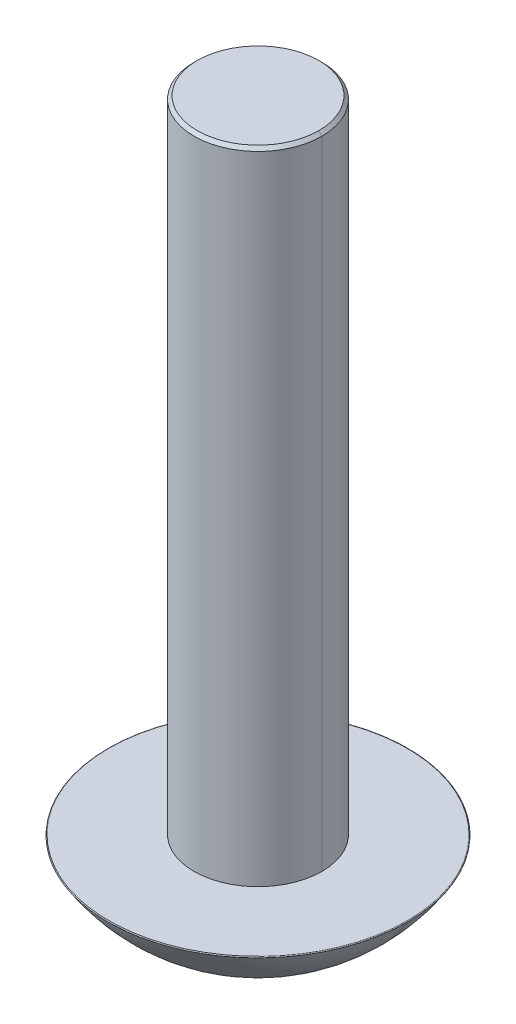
ISO-10303-21;
HEADER;
FILE_DESCRIPTION(('STEP AP214'),'2;1');
FILE_NAME('part.step','',(''),(''),'','','');
FILE_SCHEMA(('AUTOMOTIVE_DESIGN { 1 0 10303 214 1 1 1 1 }'));
ENDSEC;
DATA;
#1=APPLICATION_CONTEXT('core data for automotive mechanical design processes');
#2=APPLICATION_PROTOCOL_DEFINITION('international standard','automotive_design',2000,#1);
#3=PRODUCT_CONTEXT('',#1,'mechanical');
#4=PRODUCT('Part','Part','',(#3));
#5=PRODUCT_RELATED_PRODUCT_CATEGORY('part','',(#4));
#6=PRODUCT_DEFINITION_FORMATION('','',#4);
#7=PRODUCT_DEFINITION_CONTEXT('part definition',#1,'design');
#8=PRODUCT_DEFINITION('design','',#6,#7);
#9=PRODUCT_DEFINITION_SHAPE('','',#8);
#10=(LENGTH_UNIT() NAMED_UNIT(*) SI_UNIT(.MILLI.,.METRE.));
#11=(NAMED_UNIT(*) PLANE_ANGLE_UNIT() SI_UNIT($,.RADIAN.));
#12=(NAMED_UNIT(*) SI_UNIT($,.STERADIAN.) SOLID_ANGLE_UNIT());
#13=UNCERTAINTY_MEASURE_WITH_UNIT(LENGTH_MEASURE(1.E-05),#10,'distance_accuracy_value','');
#14=(GEOMETRIC_REPRESENTATION_CONTEXT(3) GLOBAL_UNCERTAINTY_ASSIGNED_CONTEXT((#13)) GLOBAL_UNIT_ASSIGNED_CONTEXT((#10,
#11,#12)) REPRESENTATION_CONTEXT('',''));
#15=CARTESIAN_POINT('',(0.,0.,0.));
#16=DIRECTION('',(0.,0.,1.));
#17=DIRECTION('',(1.,0.,0.));
#18=AXIS2_PLACEMENT_3D('',#15,#16,#17);
#19=CARTESIAN_POINT('',(2.1,-6.85,0.45));
#20=DIRECTION('',(0.355995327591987,0.934487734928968,0.));
#21=DIRECTION('',(0.,0.,-1.));
#22=AXIS2_PLACEMENT_3D('',#19,#20,#21);
#23=PLANE('',#22);
#24=DIRECTION('',(0.,0.,1.));
#25=VECTOR('',#24,1.);
#26=CARTESIAN_POINT('',(2.1,-6.85,0.45));
#27=LINE('',#26,#25);
#28=CARTESIAN_POINT('',(2.1,-6.85,-0.45));
#29=VERTEX_POINT('',#28);
#30=CARTESIAN_POINT('',(2.1,-6.85,0.45));
#31=VERTEX_POINT('',#30);
#32=EDGE_CURVE('E625',#29,#31,#27,.T.);
#33=ORIENTED_EDGE('',*,*,#32,.T.);
#34=DIRECTION('',(-0.916296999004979,0.349065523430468,-0.196349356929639));
#35=VECTOR('',#34,1.);
#36=CARTESIAN_POINT('',(1.05,-6.45,0.225));
#37=LINE('',#36,#35);
#38=CARTESIAN_POINT('',(0.,-6.05,0.));
#39=VERTEX_POINT('',#38);
#40=EDGE_CURVE('E9',#31,#39,#37,.T.);
#41=ORIENTED_EDGE('',*,*,#40,.T.);
#42=DIRECTION('',(-0.916296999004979,0.349065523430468,0.196349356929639));
#43=VECTOR('',#42,1.);
#44=CARTESIAN_POINT('',(1.05,-6.45,-0.225));
#45=LINE('',#44,#43);
#46=EDGE_CURVE('E629',#29,#39,#45,.T.);
#47=ORIENTED_EDGE('',*,*,#46,.F.);
#48=EDGE_LOOP('',(#33,#41,#47));
#49=FACE_BOUND('',#48,.T.);
#50=ADVANCED_FACE('F15',(#49),#23,.F.);
#51=CARTESIAN_POINT('',(0.45,-6.85,2.1));
#52=CARTESIAN_POINT('',(0.,-6.05,0.));
#53=CARTESIAN_POINT('',(0.45,-6.85,1.97916666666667));
#54=CARTESIAN_POINT('',(0.,-6.05,0.));
#55=CARTESIAN_POINT('',(0.45,-6.85,1.7375));
#56=CARTESIAN_POINT('',(0.,-6.05,0.));
#57=CARTESIAN_POINT('',(0.45,-6.85,1.375));
#58=CARTESIAN_POINT('',(0.,-6.05,0.));
#59=CARTESIAN_POINT('',(0.45,-6.85,1.0125));
#60=CARTESIAN_POINT('',(0.,-6.05,0.));
#61=CARTESIAN_POINT('',(0.45,-6.85,0.770833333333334));
#62=CARTESIAN_POINT('',(0.,-6.05,0.));
#63=CARTESIAN_POINT('',(0.45,-6.85,0.623820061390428));
#64=CARTESIAN_POINT('',(0.,-6.05,0.));
#65=CARTESIAN_POINT('',(0.460399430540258,-6.85,0.571466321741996));
#66=CARTESIAN_POINT('',(0.,-6.05,0.));
#67=CARTESIAN_POINT('',(0.504909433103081,-6.85,0.504879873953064));
#68=CARTESIAN_POINT('',(0.,-6.05,0.));
#69=CARTESIAN_POINT('',(0.571460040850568,-6.85,0.460409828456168));
#70=CARTESIAN_POINT('',(0.,-6.05,0.));
#71=CARTESIAN_POINT('',(0.623820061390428,-6.85,0.45));
#72=CARTESIAN_POINT('',(0.,-6.05,0.));
#73=CARTESIAN_POINT('',(0.770833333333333,-6.85,0.45));
#74=CARTESIAN_POINT('',(0.,-6.05,0.));
#75=CARTESIAN_POINT('',(1.0125,-6.85,0.45));
#76=CARTESIAN_POINT('',(0.,-6.05,0.));
#77=CARTESIAN_POINT('',(1.375,-6.85,0.45));
#78=CARTESIAN_POINT('',(0.,-6.05,0.));
#79=CARTESIAN_POINT('',(1.7375,-6.85,0.45));
#80=CARTESIAN_POINT('',(0.,-6.05,0.));
#81=CARTESIAN_POINT('',(1.97916666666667,-6.85,0.45));
#82=CARTESIAN_POINT('',(0.,-6.05,0.));
#83=CARTESIAN_POINT('',(2.1,-6.85,0.45));
#84=CARTESIAN_POINT('',(0.,-6.05,0.));
#85=(BOUNDED_SURFACE() B_SPLINE_SURFACE(3,1,((#51,#52),(#53,#54),(#55,#56),(#57,#58),(#59,#60),
(#61,#62),(#63,#64),(#65,#66),(#67,#68),(#69,#70),(#71,#72),(#73,#74),(#75,#76),(#77,#78),(#79,
#80),(#81,#82),(#83,#84)),.UNSPECIFIED.,.F.,.F.,.F.) B_SPLINE_SURFACE_WITH_KNOTS((4,1,1,1,2,1,1,
1,2,1,1,1,4),(2,2),(0.,0.112782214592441,0.225564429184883,0.338346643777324,0.451128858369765,
0.475564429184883,0.5,0.524435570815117,0.548871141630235,0.661653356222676,0.774435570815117,
0.887217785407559,1.),(0.,1.),
.UNSPECIFIED.) GEOMETRIC_REPRESENTATION_ITEM() RATIONAL_B_SPLINE_SURFACE(((1.,1.),(1.,1.),(1.,
1.),(1.,1.),(1.,1.),(1.,1.),(1.,1.),(1.,1.),(1.,1.),(1.,1.),(1.,1.),(1.,1.),(1.,1.),(1.,1.),(1.,
1.),(1.,1.),(1.,1.))) REPRESENTATION_ITEM('') SURFACE());
#86=CARTESIAN_POINT('',(0.45,-6.85,0.65));
#87=CARTESIAN_POINT('',(0.45,-6.85,0.770833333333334));
#88=CARTESIAN_POINT('',(0.45,-6.85,1.0125));
#89=CARTESIAN_POINT('',(0.45,-6.85,1.375));
#90=CARTESIAN_POINT('',(0.45,-6.85,1.7375));
#91=CARTESIAN_POINT('',(0.45,-6.85,1.97916666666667));
#92=CARTESIAN_POINT('',(0.45,-6.85,2.1));
#93=(BOUNDED_CURVE() B_SPLINE_CURVE(3,(#86,#87,#88,#89,#90,#91,#92),.UNSPECIFIED.,.F.,
.F.) B_SPLINE_CURVE_WITH_KNOTS((4,1,1,1,4),(0.,0.250000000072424,0.500000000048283,
0.750000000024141,1.),
.UNSPECIFIED.) CURVE() GEOMETRIC_REPRESENTATION_ITEM() RATIONAL_B_SPLINE_CURVE((1.,1.,1.,1.,1.,
1.,1.)) REPRESENTATION_ITEM(''));
#94=CARTESIAN_POINT('',(0.45,-6.85,0.65));
#95=VERTEX_POINT('',#94);
#96=CARTESIAN_POINT('',(0.45,-6.85,2.1));
#97=VERTEX_POINT('',#96);
#98=EDGE_CURVE('E242',#95,#97,#93,.T.);
#99=DIRECTION('',(-0.196349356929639,0.349065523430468,-0.916296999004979));
#100=VECTOR('',#99,1.);
#101=CARTESIAN_POINT('',(0.225,-6.45,1.05));
#102=LINE('',#101,#100);
#103=EDGE_CURVE('E26',#97,#39,#102,.T.);
#104=CARTESIAN_POINT('',(0.65,-6.85,0.45));
#105=CARTESIAN_POINT('',(1.13333333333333,-6.85,0.45));
#106=CARTESIAN_POINT('',(1.61666666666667,-6.85,0.45));
#107=CARTESIAN_POINT('',(2.1,-6.85,0.45));
#108=(BOUNDED_CURVE() B_SPLINE_CURVE(3,(#104,#105,#106,#107),.UNSPECIFIED.,.F.,
.F.) B_SPLINE_CURVE_WITH_KNOTS((4,4),(0.,1.),
.UNSPECIFIED.) CURVE() GEOMETRIC_REPRESENTATION_ITEM() RATIONAL_B_SPLINE_CURVE((1.,1.,1.,1.)) REPRESENTATION_ITEM(''));
#109=CARTESIAN_POINT('',(0.65,-6.85,0.45));
#110=VERTEX_POINT('',#109);
#111=EDGE_CURVE('E1427',#110,#31,#108,.T.);
#112=CARTESIAN_POINT('',(2.1,-6.85,0.45));
#113=CARTESIAN_POINT('',(1.97916666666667,-6.85,0.45));
#114=CARTESIAN_POINT('',(1.7375,-6.85,0.45));
#115=CARTESIAN_POINT('',(1.375,-6.85,0.45));
#116=CARTESIAN_POINT('',(1.0125,-6.85,0.45));
#117=CARTESIAN_POINT('',(0.770833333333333,-6.85,0.45));
#118=CARTESIAN_POINT('',(0.623820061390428,-6.85,0.45));
#119=CARTESIAN_POINT('',(0.571460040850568,-6.85,0.460409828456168));
#120=CARTESIAN_POINT('',(0.504909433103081,-6.85,0.504879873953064));
#121=CARTESIAN_POINT('',(0.460399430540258,-6.85,0.571466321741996));
#122=CARTESIAN_POINT('',(0.45,-6.85,0.623820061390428));
#123=CARTESIAN_POINT('',(0.45,-6.85,0.770833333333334));
#124=CARTESIAN_POINT('',(0.45,-6.85,1.0125));
#125=CARTESIAN_POINT('',(0.45,-6.85,1.375));
#126=CARTESIAN_POINT('',(0.45,-6.85,1.7375));
#127=CARTESIAN_POINT('',(0.45,-6.85,1.97916666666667));
#128=CARTESIAN_POINT('',(0.45,-6.85,2.1));
#129=(BOUNDED_CURVE() B_SPLINE_CURVE(3,(#112,#113,#114,#115,#116,#117,#118,#119,#120,#121,#122,
#123,#124,#125,#126,#127,#128),.UNSPECIFIED.,.F.,.F.) B_SPLINE_CURVE_WITH_KNOTS((4,1,1,1,2,1,1,
1,2,1,1,1,4),(0.,0.112782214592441,0.225564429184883,0.338346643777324,0.451128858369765,
0.475564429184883,0.5,0.524435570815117,0.548871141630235,0.661653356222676,0.774435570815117,
0.887217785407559,1.),
.UNSPECIFIED.) CURVE() GEOMETRIC_REPRESENTATION_ITEM() RATIONAL_B_SPLINE_CURVE((1.,1.,1.,1.,1.,
1.,1.,1.,1.,1.,1.,1.,1.,1.,1.,1.,1.)) REPRESENTATION_ITEM(''));
#130=EDGE_CURVE('E246',#95,#110,#129,.F.);
#131=ORIENTED_EDGE('',*,*,#98,.T.);
#132=ORIENTED_EDGE('',*,*,#103,.T.);
#133=ORIENTED_EDGE('',*,*,#40,.F.);
#134=ORIENTED_EDGE('',*,*,#111,.F.);
#135=ORIENTED_EDGE('',*,*,#130,.F.);
#136=EDGE_LOOP('',(#131,#132,#133,#134,#135));
#137=FACE_BOUND('',#136,.T.);
#138=ADVANCED_FACE('F244',(#137),#85,.F.);
#139=CARTESIAN_POINT('',(-0.45,-6.85,2.1));
#140=DIRECTION('',(0.,0.934487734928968,0.355995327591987));
#141=DIRECTION('',(1.,0.,0.));
#142=AXIS2_PLACEMENT_3D('',#139,#140,#141);
#143=PLANE('',#142);
#144=DIRECTION('',(-1.,0.,0.));
#145=VECTOR('',#144,1.);
#146=CARTESIAN_POINT('',(-0.45,-6.85,2.1));
#147=LINE('',#146,#145);
#148=CARTESIAN_POINT('',(-0.45,-6.85,2.1));
#149=VERTEX_POINT('',#148);
#150=EDGE_CURVE('E236',#97,#149,#147,.T.);
#151=ORIENTED_EDGE('',*,*,#150,.T.);
#152=DIRECTION('',(0.196349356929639,0.349065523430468,-0.916296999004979));
#153=VECTOR('',#152,1.);
#154=CARTESIAN_POINT('',(-0.225,-6.45,1.05));
#155=LINE('',#154,#153);
#156=EDGE_CURVE('E227',#149,#39,#155,.T.);
#157=ORIENTED_EDGE('',*,*,#156,.T.);
#158=ORIENTED_EDGE('',*,*,#103,.F.);
#159=EDGE_LOOP('',(#151,#157,#158));
#160=FACE_BOUND('',#159,.T.);
#161=ADVANCED_FACE('F234',(#160),#143,.F.);
#162=CARTESIAN_POINT('',(-2.1,-6.85,0.35));
#163=CARTESIAN_POINT('',(0.,-6.05,0.));
#164=CARTESIAN_POINT('',(-1.97916666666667,-6.85,0.35));
#165=CARTESIAN_POINT('',(0.,-6.05,0.));
#166=CARTESIAN_POINT('',(-1.7375,-6.85,0.35));
#167=CARTESIAN_POINT('',(0.,-6.05,0.));
#168=CARTESIAN_POINT('',(-1.375,-6.85,0.35));
#169=CARTESIAN_POINT('',(0.,-6.05,0.));
#170=CARTESIAN_POINT('',(-1.0125,-6.85,0.35));
#171=CARTESIAN_POINT('',(0.,-6.05,0.));
#172=CARTESIAN_POINT('',(-0.770833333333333,-6.85,0.35));
#173=CARTESIAN_POINT('',(0.,-6.05,0.));
#174=CARTESIAN_POINT('',(-0.623820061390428,-6.85,0.35));
#175=CARTESIAN_POINT('',(0.,-6.05,0.));
#176=CARTESIAN_POINT('',(-0.571466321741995,-6.85,0.360399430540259));
#177=CARTESIAN_POINT('',(0.,-6.05,0.));
#178=CARTESIAN_POINT('',(-0.504879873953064,-6.85,0.40490943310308));
#179=CARTESIAN_POINT('',(0.,-6.05,0.));
#180=CARTESIAN_POINT('',(-0.460409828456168,-6.85,0.471460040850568));
#181=CARTESIAN_POINT('',(0.,-6.05,0.));
#182=CARTESIAN_POINT('',(-0.45,-6.85,0.523820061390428));
#183=CARTESIAN_POINT('',(0.,-6.05,0.));
#184=CARTESIAN_POINT('',(-0.45,-6.85,0.679166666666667));
#185=CARTESIAN_POINT('',(0.,-6.05,0.));
#186=CARTESIAN_POINT('',(-0.45,-6.85,0.9375));
#187=CARTESIAN_POINT('',(0.,-6.05,0.));
#188=CARTESIAN_POINT('',(-0.45,-6.85,1.325));
#189=CARTESIAN_POINT('',(0.,-6.05,0.));
#190=CARTESIAN_POINT('',(-0.45,-6.85,1.7125));
#191=CARTESIAN_POINT('',(0.,-6.05,0.));
#192=CARTESIAN_POINT('',(-0.45,-6.85,1.97083333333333));
#193=CARTESIAN_POINT('',(0.,-6.05,0.));
#194=CARTESIAN_POINT('',(-0.45,-6.85,2.1));
#195=CARTESIAN_POINT('',(0.,-6.05,0.));
#196=(BOUNDED_SURFACE() B_SPLINE_SURFACE(3,1,((#162,#163),(#164,#165),(#166,#167),(#168,#169),
(#170,#171),(#172,#173),(#174,#175),(#176,#177),(#178,#179),(#180,#181),(#182,#183),(#184,#185),
(#186,#187),(#188,#189),(#190,#191),(#192,#193),(#194,#195)),.UNSPECIFIED.,.F.,.F.,
.F.) B_SPLINE_SURFACE_WITH_KNOTS((4,1,1,1,2,1,1,1,2,1,1,1,4),(2,2),(0.,0.109379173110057,
0.218758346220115,0.328137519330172,0.437516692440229,0.461214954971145,0.484913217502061,
0.508611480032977,0.532309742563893,0.64923230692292,0.766154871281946,0.883077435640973,1.),
(0.,1.),.UNSPECIFIED.) GEOMETRIC_REPRESENTATION_ITEM() RATIONAL_B_SPLINE_SURFACE(((1.,1.),(1.,
1.),(1.,1.),(1.,1.),(1.,1.),(1.,1.),(1.,1.),(1.,1.),(1.,1.),(1.,1.),(1.,1.),(1.,1.),(1.,1.),(1.,
1.),(1.,1.),(1.,1.),(1.,1.))) REPRESENTATION_ITEM('') SURFACE());
#197=CARTESIAN_POINT('',(-0.65,-6.85,0.35));
#198=CARTESIAN_POINT('',(-0.770833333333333,-6.85,0.35));
#199=CARTESIAN_POINT('',(-1.0125,-6.85,0.35));
#200=CARTESIAN_POINT('',(-1.375,-6.85,0.35));
#201=CARTESIAN_POINT('',(-1.7375,-6.85,0.35));
#202=CARTESIAN_POINT('',(-1.97916666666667,-6.85,0.35));
#203=CARTESIAN_POINT('',(-2.1,-6.85,0.35));
#204=(BOUNDED_CURVE() B_SPLINE_CURVE(3,(#197,#198,#199,#200,#201,#202,#203),.UNSPECIFIED.,.F.,
.F.) B_SPLINE_CURVE_WITH_KNOTS((4,1,1,1,4),(0.,0.250000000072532,0.500000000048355,
0.750000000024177,1.),
.UNSPECIFIED.) CURVE() GEOMETRIC_REPRESENTATION_ITEM() RATIONAL_B_SPLINE_CURVE((1.,1.,1.,1.,1.,
1.,1.)) REPRESENTATION_ITEM(''));
#205=CARTESIAN_POINT('',(-0.65,-6.85,0.35));
#206=VERTEX_POINT('',#205);
#207=CARTESIAN_POINT('',(-2.1,-6.85,0.35));
#208=VERTEX_POINT('',#207);
#209=EDGE_CURVE('E469',#206,#208,#204,.T.);
#210=DIRECTION('',(0.923355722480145,0.351754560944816,-0.153892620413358));
#211=VECTOR('',#210,1.);
#212=CARTESIAN_POINT('',(-1.05,-6.45,0.175));
#213=LINE('',#212,#211);
#214=EDGE_CURVE('E146',#208,#39,#213,.T.);
#215=CARTESIAN_POINT('',(-0.45,-6.85,2.1));
#216=CARTESIAN_POINT('',(-0.45,-6.85,1.97083333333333));
#217=CARTESIAN_POINT('',(-0.45,-6.85,1.7125));
#218=CARTESIAN_POINT('',(-0.45,-6.85,1.325));
#219=CARTESIAN_POINT('',(-0.45,-6.85,0.9375));
#220=CARTESIAN_POINT('',(-0.45,-6.85,0.679166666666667));
#221=CARTESIAN_POINT('',(-0.45,-6.85,0.55));
#222=(BOUNDED_CURVE() B_SPLINE_CURVE(3,(#215,#216,#217,#218,#219,#220,#221),.UNSPECIFIED.,.F.,
.F.) B_SPLINE_CURVE_WITH_KNOTS((4,1,1,1,4),(0.,0.249999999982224,0.499999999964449,
0.749999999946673,1.),
.UNSPECIFIED.) CURVE() GEOMETRIC_REPRESENTATION_ITEM() RATIONAL_B_SPLINE_CURVE((1.,1.,1.,1.,1.,
1.,1.)) REPRESENTATION_ITEM(''));
#223=CARTESIAN_POINT('',(-0.45,-6.85,0.55));
#224=VERTEX_POINT('',#223);
#225=EDGE_CURVE('E273',#149,#224,#222,.T.);
#226=CARTESIAN_POINT('',(-0.449999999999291,-6.84999999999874,2.09999999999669));
#227=CARTESIAN_POINT('',(-0.449999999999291,-6.84999999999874,1.97083333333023));
#228=CARTESIAN_POINT('',(-0.449999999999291,-6.84999999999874,1.7124999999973));
#229=CARTESIAN_POINT('',(-0.449999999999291,-6.84999999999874,1.32499999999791));
#230=CARTESIAN_POINT('',(-0.449999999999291,-6.84999999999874,0.937499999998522));
#231=CARTESIAN_POINT('',(-0.449999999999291,-6.84999999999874,0.679166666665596));
#232=CARTESIAN_POINT('',(-0.449999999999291,-6.84999999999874,0.523820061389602));
#233=CARTESIAN_POINT('',(-0.460409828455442,-6.84999999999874,0.471460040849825));
#234=CARTESIAN_POINT('',(-0.504879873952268,-6.84999999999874,0.404909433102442));
#235=CARTESIAN_POINT('',(-0.571466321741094,-6.84999999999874,0.360399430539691));
#236=CARTESIAN_POINT('',(-0.623820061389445,-6.84999999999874,0.349999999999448));
#237=CARTESIAN_POINT('',(-0.770833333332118,-6.84999999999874,0.349999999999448));
#238=CARTESIAN_POINT('',(-1.0124999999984,-6.84999999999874,0.349999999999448));
#239=CARTESIAN_POINT('',(-1.37499999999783,-6.84999999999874,0.349999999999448));
#240=CARTESIAN_POINT('',(-1.73749999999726,-6.84999999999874,0.349999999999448));
#241=CARTESIAN_POINT('',(-1.97916666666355,-6.84999999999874,0.349999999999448));
#242=CARTESIAN_POINT('',(-2.09999999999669,-6.84999999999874,0.349999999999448));
#243=(BOUNDED_CURVE() B_SPLINE_CURVE(3,(#226,#227,#228,#229,#230,#231,#232,#233,#234,#235,#236,
#237,#238,#239,#240,#241,#242),.UNSPECIFIED.,.F.,.F.) B_SPLINE_CURVE_WITH_KNOTS((4,1,1,1,2,1,1,
1,2,1,1,1,4),(0.,0.116922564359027,0.233845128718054,0.35076769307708,0.467690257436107,
0.491388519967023,0.515086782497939,0.538785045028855,0.562483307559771,0.671862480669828,
0.781241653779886,0.890620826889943,1.),
.UNSPECIFIED.) CURVE() GEOMETRIC_REPRESENTATION_ITEM() RATIONAL_B_SPLINE_CURVE((1.,1.,1.,1.,1.,
1.,1.,1.,1.,1.,1.,1.,1.,1.,1.,1.,1.)) REPRESENTATION_ITEM(''));
#244=EDGE_CURVE('E133',#224,#206,#243,.T.);
#245=ORIENTED_EDGE('',*,*,#209,.T.);
#246=ORIENTED_EDGE('',*,*,#214,.T.);
#247=ORIENTED_EDGE('',*,*,#156,.F.);
#248=ORIENTED_EDGE('',*,*,#225,.T.);
#249=ORIENTED_EDGE('',*,*,#244,.T.);
#250=EDGE_LOOP('',(#245,#246,#247,#248,#249));
#251=FACE_BOUND('',#250,.T.);
#252=ADVANCED_FACE('F778',(#251),#196,.F.);
#253=CARTESIAN_POINT('',(-2.1,-6.85,-0.45));
#254=DIRECTION('',(-0.355995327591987,0.934487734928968,0.));
#255=DIRECTION('',(0.,0.,1.));
#256=AXIS2_PLACEMENT_3D('',#253,#254,#255);
#257=PLANE('',#256);
#258=DIRECTION('',(0.,0.,-1.));
#259=VECTOR('',#258,1.);
#260=CARTESIAN_POINT('',(-2.1,-6.85,-0.45));
#261=LINE('',#260,#259);
#262=CARTESIAN_POINT('',(-2.1,-6.85,-0.45));
#263=VERTEX_POINT('',#262);
#264=EDGE_CURVE('E1459',#208,#263,#261,.T.);
#265=ORIENTED_EDGE('',*,*,#264,.T.);
#266=DIRECTION('',(0.916296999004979,0.349065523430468,0.196349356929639));
#267=VECTOR('',#266,1.);
#268=CARTESIAN_POINT('',(-1.05,-6.45,-0.225));
#269=LINE('',#268,#267);
#270=EDGE_CURVE('E632',#263,#39,#269,.T.);
#271=ORIENTED_EDGE('',*,*,#270,.T.);
#272=ORIENTED_EDGE('',*,*,#214,.F.);
#273=EDGE_LOOP('',(#265,#271,#272));
#274=FACE_BOUND('',#273,.T.);
#275=ADVANCED_FACE('F360',(#274),#257,.F.);
#276=CARTESIAN_POINT('',(-0.45,-6.85,-2.1));
#277=CARTESIAN_POINT('',(0.,-6.05,0.));
#278=CARTESIAN_POINT('',(-0.45,-6.85,-1.97916666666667));
#279=CARTESIAN_POINT('',(0.,-6.05,0.));
#280=CARTESIAN_POINT('',(-0.45,-6.85,-1.7375));
#281=CARTESIAN_POINT('',(0.,-6.05,0.));
#282=CARTESIAN_POINT('',(-0.45,-6.85,-1.375));
#283=CARTESIAN_POINT('',(0.,-6.05,0.));
#284=CARTESIAN_POINT('',(-0.45,-6.85,-1.0125));
#285=CARTESIAN_POINT('',(0.,-6.05,0.));
#286=CARTESIAN_POINT('',(-0.45,-6.85,-0.770833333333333));
#287=CARTESIAN_POINT('',(0.,-6.05,0.));
#288=CARTESIAN_POINT('',(-0.45,-6.85,-0.623820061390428));
#289=CARTESIAN_POINT('',(0.,-6.05,0.));
#290=CARTESIAN_POINT('',(-0.460399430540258,-6.85,-0.571466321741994));
#291=CARTESIAN_POINT('',(0.,-6.05,0.));
#292=CARTESIAN_POINT('',(-0.504909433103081,-6.85,-0.504879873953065));
#293=CARTESIAN_POINT('',(0.,-6.05,0.));
#294=CARTESIAN_POINT('',(-0.571460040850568,-6.85,-0.460409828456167));
#295=CARTESIAN_POINT('',(0.,-6.05,0.));
#296=CARTESIAN_POINT('',(-0.623820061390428,-6.85,-0.45));
#297=CARTESIAN_POINT('',(0.,-6.05,0.));
#298=CARTESIAN_POINT('',(-0.770833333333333,-6.85,-0.45));
#299=CARTESIAN_POINT('',(0.,-6.05,0.));
#300=CARTESIAN_POINT('',(-1.0125,-6.85,-0.45));
#301=CARTESIAN_POINT('',(0.,-6.05,0.));
#302=CARTESIAN_POINT('',(-1.375,-6.85,-0.45));
#303=CARTESIAN_POINT('',(0.,-6.05,0.));
#304=CARTESIAN_POINT('',(-1.7375,-6.85,-0.45));
#305=CARTESIAN_POINT('',(0.,-6.05,0.));
#306=CARTESIAN_POINT('',(-1.97916666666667,-6.85,-0.45));
#307=CARTESIAN_POINT('',(0.,-6.05,0.));
#308=CARTESIAN_POINT('',(-2.1,-6.85,-0.45));
#309=CARTESIAN_POINT('',(0.,-6.05,0.));
#310=(BOUNDED_SURFACE() B_SPLINE_SURFACE(3,1,((#276,#277),(#278,#279),(#280,#281),(#282,#283),
(#284,#285),(#286,#287),(#288,#289),(#290,#291),(#292,#293),(#294,#295),(#296,#297),(#298,#299),
(#300,#301),(#302,#303),(#304,#305),(#306,#307),(#308,#309)),.UNSPECIFIED.,.F.,.F.,
.F.) B_SPLINE_SURFACE_WITH_KNOTS((4,1,1,1,2,1,1,1,2,1,1,1,4),(2,2),(0.,0.112782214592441,
0.225564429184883,0.338346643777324,0.451128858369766,0.475564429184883,0.5,0.524435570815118,
0.548871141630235,0.661653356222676,0.774435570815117,0.887217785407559,1.),(0.,1.),
.UNSPECIFIED.) GEOMETRIC_REPRESENTATION_ITEM() RATIONAL_B_SPLINE_SURFACE(((1.,1.),(1.,1.),(1.,
1.),(1.,1.),(1.,1.),(1.,1.),(1.,1.),(1.,1.),(1.,1.),(1.,1.),(1.,1.),(1.,1.),(1.,1.),(1.,1.),(1.,
1.),(1.,1.),(1.,1.))) REPRESENTATION_ITEM('') SURFACE());
#311=CARTESIAN_POINT('',(-0.45,-6.85,-0.65));
#312=CARTESIAN_POINT('',(-0.45,-6.85,-0.770833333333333));
#313=CARTESIAN_POINT('',(-0.45,-6.85,-1.0125));
#314=CARTESIAN_POINT('',(-0.45,-6.85,-1.375));
#315=CARTESIAN_POINT('',(-0.45,-6.85,-1.7375));
#316=CARTESIAN_POINT('',(-0.45,-6.85,-1.97916666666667));
#317=CARTESIAN_POINT('',(-0.45,-6.85,-2.1));
#318=(BOUNDED_CURVE() B_SPLINE_CURVE(3,(#311,#312,#313,#314,#315,#316,#317),.UNSPECIFIED.,.F.,
.F.) B_SPLINE_CURVE_WITH_KNOTS((4,1,1,1,4),(0.,0.250000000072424,0.500000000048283,
0.750000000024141,1.),
.UNSPECIFIED.) CURVE() GEOMETRIC_REPRESENTATION_ITEM() RATIONAL_B_SPLINE_CURVE((1.,1.,1.,1.,1.,
1.,1.)) REPRESENTATION_ITEM(''));
#319=CARTESIAN_POINT('',(-0.45,-6.85,-0.65));
#320=VERTEX_POINT('',#319);
#321=CARTESIAN_POINT('',(-0.45,-6.85,-2.1));
#322=VERTEX_POINT('',#321);
#323=EDGE_CURVE('E302',#320,#322,#318,.T.);
#324=DIRECTION('',(0.196349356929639,0.349065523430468,0.916296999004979));
#325=VECTOR('',#324,1.);
#326=CARTESIAN_POINT('',(-0.225,-6.45,-1.05));
#327=LINE('',#326,#325);
#328=EDGE_CURVE('E633',#322,#39,#327,.T.);
#329=CARTESIAN_POINT('',(-0.65,-6.85,-0.45));
#330=CARTESIAN_POINT('',(-1.13333333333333,-6.85,-0.45));
#331=CARTESIAN_POINT('',(-1.61666666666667,-6.85,-0.45));
#332=CARTESIAN_POINT('',(-2.1,-6.85,-0.45));
#333=(BOUNDED_CURVE() B_SPLINE_CURVE(3,(#329,#330,#331,#332),.UNSPECIFIED.,.F.,
.F.) B_SPLINE_CURVE_WITH_KNOTS((4,4),(0.,1.),
.UNSPECIFIED.) CURVE() GEOMETRIC_REPRESENTATION_ITEM() RATIONAL_B_SPLINE_CURVE((1.,1.,1.,1.)) REPRESENTATION_ITEM(''));
#334=CARTESIAN_POINT('',(-0.65,-6.85,-0.45));
#335=VERTEX_POINT('',#334);
#336=EDGE_CURVE('E701',#335,#263,#333,.T.);
#337=CARTESIAN_POINT('',(-2.1,-6.85,-0.45));
#338=CARTESIAN_POINT('',(-1.97916666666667,-6.85,-0.45));
#339=CARTESIAN_POINT('',(-1.7375,-6.85,-0.45));
#340=CARTESIAN_POINT('',(-1.375,-6.85,-0.45));
#341=CARTESIAN_POINT('',(-1.0125,-6.85,-0.45));
#342=CARTESIAN_POINT('',(-0.770833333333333,-6.85,-0.45));
#343=CARTESIAN_POINT('',(-0.623820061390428,-6.85,-0.45));
#344=CARTESIAN_POINT('',(-0.571460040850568,-6.85,-0.460409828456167));
#345=CARTESIAN_POINT('',(-0.504909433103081,-6.85,-0.504879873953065));
#346=CARTESIAN_POINT('',(-0.460399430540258,-6.85,-0.571466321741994));
#347=CARTESIAN_POINT('',(-0.45,-6.85,-0.623820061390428));
#348=CARTESIAN_POINT('',(-0.45,-6.85,-0.770833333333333));
#349=CARTESIAN_POINT('',(-0.45,-6.85,-1.0125));
#350=CARTESIAN_POINT('',(-0.45,-6.85,-1.375));
#351=CARTESIAN_POINT('',(-0.45,-6.85,-1.7375));
#352=CARTESIAN_POINT('',(-0.45,-6.85,-1.97916666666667));
#353=CARTESIAN_POINT('',(-0.45,-6.85,-2.1));
#354=(BOUNDED_CURVE() B_SPLINE_CURVE(3,(#337,#338,#339,#340,#341,#342,#343,#344,#345,#346,#347,
#348,#349,#350,#351,#352,#353),.UNSPECIFIED.,.F.,.F.) B_SPLINE_CURVE_WITH_KNOTS((4,1,1,1,2,1,1,
1,2,1,1,1,4),(0.,0.112782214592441,0.225564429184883,0.338346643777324,0.451128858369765,
0.475564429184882,0.5,0.524435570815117,0.548871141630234,0.661653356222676,0.774435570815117,
0.887217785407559,1.),
.UNSPECIFIED.) CURVE() GEOMETRIC_REPRESENTATION_ITEM() RATIONAL_B_SPLINE_CURVE((1.,1.,1.,1.,1.,
1.,1.,1.,1.,1.,1.,1.,1.,1.,1.,1.,1.)) REPRESENTATION_ITEM(''));
#355=EDGE_CURVE('E486',#320,#335,#354,.F.);
#356=ORIENTED_EDGE('',*,*,#323,.T.);
#357=ORIENTED_EDGE('',*,*,#328,.T.);
#358=ORIENTED_EDGE('',*,*,#270,.F.);
#359=ORIENTED_EDGE('',*,*,#336,.F.);
#360=ORIENTED_EDGE('',*,*,#355,.F.);
#361=EDGE_LOOP('',(#356,#357,#358,#359,#360));
#362=FACE_BOUND('',#361,.T.);
#363=ADVANCED_FACE('F901',(#362),#310,.F.);
#364=CARTESIAN_POINT('',(2.1,-6.85,-0.45));
#365=DIRECTION('',(0.,0.490261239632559,-0.871575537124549));
#366=DIRECTION('',(-1.,0.,0.));
#367=AXIS2_PLACEMENT_3D('',#364,#365,#366);
#368=PLANE('',#367);
#369=CARTESIAN_POINT('',(0.65,-6.85,-0.45));
#370=CARTESIAN_POINT('',(1.13333333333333,-6.85,-0.45));
#371=CARTESIAN_POINT('',(1.61666666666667,-6.85,-0.45));
#372=CARTESIAN_POINT('',(2.1,-6.85,-0.45));
#373=(BOUNDED_CURVE() B_SPLINE_CURVE(3,(#369,#370,#371,#372),.UNSPECIFIED.,.F.,
.F.) B_SPLINE_CURVE_WITH_KNOTS((4,4),(0.,1.),
.UNSPECIFIED.) CURVE() GEOMETRIC_REPRESENTATION_ITEM() RATIONAL_B_SPLINE_CURVE((1.,1.,1.,1.)) REPRESENTATION_ITEM(''));
#374=CARTESIAN_POINT('',(0.65,-6.85,-0.45));
#375=VERTEX_POINT('',#374);
#376=EDGE_CURVE('E612',#375,#29,#373,.T.);
#377=ORIENTED_EDGE('',*,*,#376,.T.);
#378=ORIENTED_EDGE('',*,*,#46,.T.);
#379=DIRECTION('',(0.577920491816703,-0.711286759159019,-0.400098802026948));
#380=VECTOR('',#379,1.);
#381=CARTESIAN_POINT('',(0.325,-6.45,-0.225));
#382=LINE('',#381,#380);
#383=EDGE_CURVE('E608',#39,#375,#382,.T.);
#384=ORIENTED_EDGE('',*,*,#383,.T.);
#385=EDGE_LOOP('',(#377,#378,#384));
#386=FACE_BOUND('',#385,.T.);
#387=ADVANCED_FACE('F955',(#386),#368,.F.);
#388=CARTESIAN_POINT('',(0.45,-6.85,-2.1));
#389=DIRECTION('',(0.,0.934487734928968,-0.355995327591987));
#390=DIRECTION('',(-1.,0.,0.));
#391=AXIS2_PLACEMENT_3D('',#388,#389,#390);
#392=PLANE('',#391);
#393=DIRECTION('',(-1.,0.,0.));
#394=VECTOR('',#393,1.);
#395=CARTESIAN_POINT('',(0.45,-6.85,-2.1));
#396=LINE('',#395,#394);
#397=CARTESIAN_POINT('',(0.45,-6.85,-2.1));
#398=VERTEX_POINT('',#397);
#399=EDGE_CURVE('E303',#398,#322,#396,.T.);
#400=ORIENTED_EDGE('',*,*,#399,.F.);
#401=DIRECTION('',(-0.196349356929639,0.349065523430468,0.916296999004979));
#402=VECTOR('',#401,1.);
#403=CARTESIAN_POINT('',(0.225,-6.45,-1.05));
#404=LINE('',#403,#402);
#405=EDGE_CURVE('E611',#398,#39,#404,.T.);
#406=ORIENTED_EDGE('',*,*,#405,.T.);
#407=ORIENTED_EDGE('',*,*,#328,.F.);
#408=EDGE_LOOP('',(#400,#406,#407));
#409=FACE_BOUND('',#408,.T.);
#410=ADVANCED_FACE('F438',(#409),#392,.F.);
#411=CARTESIAN_POINT('',(0.65,-6.85,-0.45));
#412=CARTESIAN_POINT('',(0.,-6.05,0.));
#413=CARTESIAN_POINT('',(0.623820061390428,-6.85,-0.45));
#414=CARTESIAN_POINT('',(0.,-6.05,0.));
#415=CARTESIAN_POINT('',(0.571466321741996,-6.85,-0.460399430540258));
#416=CARTESIAN_POINT('',(0.,-6.05,0.));
#417=CARTESIAN_POINT('',(0.504879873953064,-6.85,-0.504909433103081));
#418=CARTESIAN_POINT('',(0.,-6.05,0.));
#419=CARTESIAN_POINT('',(0.460409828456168,-6.85,-0.571460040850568));
#420=CARTESIAN_POINT('',(0.,-6.05,0.));
#421=CARTESIAN_POINT('',(0.45,-6.85,-0.623820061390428));
#422=CARTESIAN_POINT('',(0.,-6.05,0.));
#423=CARTESIAN_POINT('',(0.45,-6.85,-0.770833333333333));
#424=CARTESIAN_POINT('',(0.,-6.05,0.));
#425=CARTESIAN_POINT('',(0.45,-6.85,-1.0125));
#426=CARTESIAN_POINT('',(0.,-6.05,0.));
#427=CARTESIAN_POINT('',(0.45,-6.85,-1.375));
#428=CARTESIAN_POINT('',(0.,-6.05,0.));
#429=CARTESIAN_POINT('',(0.45,-6.85,-1.7375));
#430=CARTESIAN_POINT('',(0.,-6.05,0.));
#431=CARTESIAN_POINT('',(0.45,-6.85,-1.97916666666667));
#432=CARTESIAN_POINT('',(0.,-6.05,0.));
#433=CARTESIAN_POINT('',(0.45,-6.85,-2.1));
#434=CARTESIAN_POINT('',(0.,-6.05,0.));
#435=(BOUNDED_SURFACE() B_SPLINE_SURFACE(3,1,((#411,#412),(#413,#414),(#415,#416),(#417,#418),
(#419,#420),(#421,#422),(#423,#424),(#425,#426),(#427,#428),(#429,#430),(#431,#432),(#433,
#434)),.UNSPECIFIED.,.F.,.F.,.F.) B_SPLINE_SURFACE_WITH_KNOTS((4,1,1,1,2,1,1,1,4),(2,2),(0.,
0.0445196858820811,0.0890393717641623,0.133559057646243,0.178078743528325,0.383559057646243,
0.589039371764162,0.794519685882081,1.),(0.,1.),
.UNSPECIFIED.) GEOMETRIC_REPRESENTATION_ITEM() RATIONAL_B_SPLINE_SURFACE(((1.,1.),(1.,1.),(1.,
1.),(1.,1.),(1.,1.),(1.,1.),(1.,1.),(1.,1.),(1.,1.),(1.,1.),(1.,1.),(1.,1.))) REPRESENTATION_ITEM('') SURFACE());
#436=CARTESIAN_POINT('',(0.449999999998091,-6.84999999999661,-2.09999999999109));
#437=CARTESIAN_POINT('',(0.449999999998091,-6.84999999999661,-1.97916666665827));
#438=CARTESIAN_POINT('',(0.449999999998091,-6.84999999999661,-1.73749999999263));
#439=CARTESIAN_POINT('',(0.449999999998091,-6.84999999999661,-1.37499999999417));
#440=CARTESIAN_POINT('',(0.449999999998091,-6.84999999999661,-1.01249999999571));
#441=CARTESIAN_POINT('',(0.449999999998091,-6.84999999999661,-0.770833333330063));
#442=CARTESIAN_POINT('',(0.449999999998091,-6.84999999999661,-0.623820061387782));
#443=CARTESIAN_POINT('',(0.460409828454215,-6.84999999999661,-0.571460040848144));
#444=CARTESIAN_POINT('',(0.504879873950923,-6.84999999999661,-0.504909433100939));
#445=CARTESIAN_POINT('',(0.571466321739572,-6.84999999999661,-0.460399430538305));
#446=CARTESIAN_POINT('',(0.623820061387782,-6.84999999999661,-0.449999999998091));
#447=CARTESIAN_POINT('',(0.649999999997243,-6.84999999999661,-0.449999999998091));
#448=(BOUNDED_CURVE() B_SPLINE_CURVE(3,(#436,#437,#438,#439,#440,#441,#442,#443,#444,#445,#446,
#447),.UNSPECIFIED.,.F.,.F.) B_SPLINE_CURVE_WITH_KNOTS((4,1,1,1,2,1,1,1,4),(0.,
0.205480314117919,0.410960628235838,0.616440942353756,0.821921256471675,0.866440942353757,
0.910960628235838,0.955480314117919,1.),
.UNSPECIFIED.) CURVE() GEOMETRIC_REPRESENTATION_ITEM() RATIONAL_B_SPLINE_CURVE((1.,1.,1.,1.,1.,
1.,1.,1.,1.,1.,1.,1.)) REPRESENTATION_ITEM(''));
#449=CARTESIAN_POINT('',(0.45,-6.85,-0.65));
#450=VERTEX_POINT('',#449);
#451=EDGE_CURVE('E616',#450,#375,#448,.T.);
#452=CARTESIAN_POINT('',(0.45,-6.85,-0.65));
#453=CARTESIAN_POINT('',(0.45,-6.85,-1.13333333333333));
#454=CARTESIAN_POINT('',(0.45,-6.85,-1.61666666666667));
#455=CARTESIAN_POINT('',(0.45,-6.85,-2.1));
#456=(BOUNDED_CURVE() B_SPLINE_CURVE(3,(#452,#453,#454,#455),.UNSPECIFIED.,.F.,
.F.) B_SPLINE_CURVE_WITH_KNOTS((4,4),(0.,1.),
.UNSPECIFIED.) CURVE() GEOMETRIC_REPRESENTATION_ITEM() RATIONAL_B_SPLINE_CURVE((1.,1.,1.,1.)) REPRESENTATION_ITEM(''));
#457=EDGE_CURVE('E642',#450,#398,#456,.T.);
#458=ORIENTED_EDGE('',*,*,#451,.T.);
#459=ORIENTED_EDGE('',*,*,#383,.F.);
#460=ORIENTED_EDGE('',*,*,#405,.F.);
#461=ORIENTED_EDGE('',*,*,#457,.F.);
#462=EDGE_LOOP('',(#458,#459,#460,#461));
#463=FACE_BOUND('',#462,.T.);
#464=ADVANCED_FACE('F768',(#463),#435,.F.);
#465=CARTESIAN_POINT('',(0.65,-6.85,-0.45));
#466=DIRECTION('',(0.,0.,-1.));
#467=DIRECTION('',(0.,-1.,0.));
#468=AXIS2_PLACEMENT_3D('',#465,#466,#467);
#469=PLANE('',#468);
#470=DIRECTION('',(0.,-1.,0.));
#471=VECTOR('',#470,1.);
#472=CARTESIAN_POINT('',(2.1,-6.85,-0.45));
#473=LINE('',#472,#471);
#474=CARTESIAN_POINT('',(2.1,-7.21273763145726,-0.45));
#475=VERTEX_POINT('',#474);
#476=EDGE_CURVE('E623',#29,#475,#473,.T.);
#477=ORIENTED_EDGE('',*,*,#476,.F.);
#478=ORIENTED_EDGE('',*,*,#376,.F.);
#479=DIRECTION('',(0.,-1.,0.));
#480=VECTOR('',#479,1.);
#481=CARTESIAN_POINT('',(0.65,-6.85,-0.45));
#482=LINE('',#481,#480);
#483=CARTESIAN_POINT('',(0.65,-7.59281092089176,-0.45));
#484=VERTEX_POINT('',#483);
#485=EDGE_CURVE('E316',#375,#484,#482,.T.);
#486=ORIENTED_EDGE('',*,*,#485,.T.);
#487=CARTESIAN_POINT('',(0.,-2.15707547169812,-0.45));
#488=DIRECTION('',(0.,0.,-1.));
#489=DIRECTION('',(-1.,0.,0.));
#490=AXIS2_PLACEMENT_3D('',#487,#488,#489);
#491=CIRCLE('',#490,5.47446069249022);
#492=EDGE_CURVE('E340',#475,#484,#491,.T.);
#493=ORIENTED_EDGE('',*,*,#492,.F.);
#494=EDGE_LOOP('',(#477,#478,#486,#493));
#495=FACE_BOUND('',#494,.T.);
#496=ADVANCED_FACE('F772',(#495),#469,.F.);
#497=CARTESIAN_POINT('',(2.1,-6.85,-0.45));
#498=DIRECTION('',(1.,0.,0.));
#499=DIRECTION('',(0.,1.,0.));
#500=AXIS2_PLACEMENT_3D('',#497,#498,#499);
#501=PLANE('',#500);
#502=DIRECTION('',(0.,-1.,0.));
#503=VECTOR('',#502,1.);
#504=CARTESIAN_POINT('',(2.1,-6.85,0.45));
#505=LINE('',#504,#503);
#506=CARTESIAN_POINT('',(2.1,-7.21273763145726,0.45));
#507=VERTEX_POINT('',#506);
#508=EDGE_CURVE('E1360',#31,#507,#505,.T.);
#509=ORIENTED_EDGE('',*,*,#508,.F.);
#510=ORIENTED_EDGE('',*,*,#32,.F.);
#511=ORIENTED_EDGE('',*,*,#476,.T.);
#512=CARTESIAN_POINT('',(2.1,-2.15707547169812,0.));
#513=DIRECTION('',(1.,0.,0.));
#514=DIRECTION('',(0.,0.,-1.));
#515=AXIS2_PLACEMENT_3D('',#512,#513,#514);
#516=CIRCLE('',#515,5.07564969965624);
#517=CARTESIAN_POINT('',(2.1,-7.23272517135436,0.));
#518=VERTEX_POINT('',#517);
#519=EDGE_CURVE('E320',#518,#475,#516,.T.);
#520=ORIENTED_EDGE('',*,*,#519,.F.);
#521=CARTESIAN_POINT('',(2.1,-2.15707547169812,0.));
#522=DIRECTION('',(1.,0.,0.));
#523=DIRECTION('',(0.,0.,-1.));
#524=AXIS2_PLACEMENT_3D('',#521,#522,#523);
#525=CIRCLE('',#524,5.07564969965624);
#526=EDGE_CURVE('E332',#507,#518,#525,.T.);
#527=ORIENTED_EDGE('',*,*,#526,.F.);
#528=EDGE_LOOP('',(#509,#510,#511,#520,#527));
#529=FACE_BOUND('',#528,.T.);
#530=ADVANCED_FACE('F809',(#529),#501,.F.);
#531=CARTESIAN_POINT('',(0.65,-6.85,0.45));
#532=DIRECTION('',(0.,0.,-1.));
#533=DIRECTION('',(-1.,0.,0.));
#534=AXIS2_PLACEMENT_3D('',#531,#532,#533);
#535=PLANE('',#534);
#536=CARTESIAN_POINT('',(0.,-2.15707547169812,0.45));
#537=DIRECTION('',(0.,0.,-1.));
#538=DIRECTION('',(-1.,0.,0.));
#539=AXIS2_PLACEMENT_3D('',#536,#537,#538);
#540=CIRCLE('',#539,5.47446069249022);
#541=CARTESIAN_POINT('',(0.65,-7.59281092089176,0.45));
#542=VERTEX_POINT('',#541);
#543=EDGE_CURVE('E384',#507,#542,#540,.T.);
#544=ORIENTED_EDGE('',*,*,#543,.T.);
#545=DIRECTION('',(0.,-1.,0.));
#546=VECTOR('',#545,1.);
#547=CARTESIAN_POINT('',(0.65,-6.85,0.45));
#548=LINE('',#547,#546);
#549=EDGE_CURVE('E1358',#110,#542,#548,.T.);
#550=ORIENTED_EDGE('',*,*,#549,.F.);
#551=ORIENTED_EDGE('',*,*,#111,.T.);
#552=ORIENTED_EDGE('',*,*,#508,.T.);
#553=EDGE_LOOP('',(#544,#550,#551,#552));
#554=FACE_BOUND('',#553,.T.);
#555=ADVANCED_FACE('F17',(#554),#535,.T.);
#556=CARTESIAN_POINT('',(0.65,-6.85,0.65));
#557=DIRECTION('',(0.,-1.,0.));
#558=DIRECTION('',(0.,0.,-1.));
#559=AXIS2_PLACEMENT_3D('',#556,#557,#558);
#560=CYLINDRICAL_SURFACE('',#559,0.2);
#561=CARTESIAN_POINT('',(0.650000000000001,-7.59281092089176,0.45));
#562=CARTESIAN_POINT('',(0.646565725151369,-7.59322158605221,0.449999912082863));
#563=CARTESIAN_POINT('',(0.643130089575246,-7.59362094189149,0.450088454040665));
#564=CARTESIAN_POINT('',(0.636289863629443,-7.5943937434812,0.450441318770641));
#565=CARTESIAN_POINT('',(0.63288522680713,-7.59476735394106,0.450704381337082));
#566=CARTESIAN_POINT('',(0.626115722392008,-7.59548866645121,0.451402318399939));
#567=CARTESIAN_POINT('',(0.62275074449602,-7.59583653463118,0.45183595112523));
#568=CARTESIAN_POINT('',(0.616068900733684,-7.5965063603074,0.452870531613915));
#569=CARTESIAN_POINT('',(0.612751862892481,-7.59682848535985,0.453470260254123));
#570=CARTESIAN_POINT('',(0.606173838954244,-7.59744682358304,0.454832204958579));
#571=CARTESIAN_POINT('',(0.602912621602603,-7.59774320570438,0.455593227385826));
#572=CARTESIAN_POINT('',(0.596453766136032,-7.59831005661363,0.45727258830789));
#573=CARTESIAN_POINT('',(0.593255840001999,-7.59858069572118,0.458189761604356));
#574=CARTESIAN_POINT('',(0.586930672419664,-7.59909605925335,0.460175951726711));
#575=CARTESIAN_POINT('',(0.583803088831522,-7.59934095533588,0.461243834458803));
#576=CARTESIAN_POINT('',(0.577625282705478,-7.59980483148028,0.463525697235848));
#577=CARTESIAN_POINT('',(0.574574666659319,-7.60002398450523,0.4647385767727));
#578=CARTESIAN_POINT('',(0.568557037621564,-7.60043637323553,0.467304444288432));
#579=CARTESIAN_POINT('',(0.565589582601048,-7.60062978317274,0.468656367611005));
#580=CARTESIAN_POINT('',(0.55974407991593,-7.60099068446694,0.471494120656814));
#581=CARTESIAN_POINT('',(0.556865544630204,-7.60115835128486,0.47297892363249));
#582=CARTESIAN_POINT('',(0.551203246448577,-7.60146776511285,0.47607604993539));
#583=CARTESIAN_POINT('',(0.548418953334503,-7.60160968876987,0.477687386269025));
#584=CARTESIAN_POINT('',(0.542950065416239,-7.60186761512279,0.481031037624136));
#585=CARTESIAN_POINT('',(0.540264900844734,-7.60198379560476,0.482762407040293));
#586=CARTESIAN_POINT('',(0.5349987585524,-7.60219023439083,0.486339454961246));
#587=CARTESIAN_POINT('',(0.532417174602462,-7.60228067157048,0.488184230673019));
#588=CARTESIAN_POINT('',(0.527362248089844,-7.60243562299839,0.491981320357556));
#589=CARTESIAN_POINT('',(0.524888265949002,-7.60250031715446,0.493932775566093));
#590=CARTESIAN_POINT('',(0.520052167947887,-7.60260378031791,0.497936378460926));
#591=CARTESIAN_POINT('',(0.517689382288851,-7.60264273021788,0.499987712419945));
#592=CARTESIAN_POINT('',(0.513078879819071,-7.60269470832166,0.504184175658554));
#593=CARTESIAN_POINT('',(0.510830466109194,-7.60270791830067,0.506328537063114));
#594=CARTESIAN_POINT('',(0.506434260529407,-7.60270840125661,0.510721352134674));
#595=CARTESIAN_POINT('',(0.504286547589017,-7.60269565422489,0.512969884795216));
#596=CARTESIAN_POINT('',(0.500083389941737,-7.60264453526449,0.517580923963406));
#597=CARTESIAN_POINT('',(0.498028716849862,-7.60260598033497,0.519944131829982));
#598=CARTESIAN_POINT('',(0.494018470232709,-7.60250324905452,0.524781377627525));
#599=CARTESIAN_POINT('',(0.49206371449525,-7.60243889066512,0.527256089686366));
#600=CARTESIAN_POINT('',(0.488260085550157,-7.60228455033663,0.532312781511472));
#601=CARTESIAN_POINT('',(0.48641207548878,-7.60219438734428,0.534895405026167));
#602=CARTESIAN_POINT('',(0.482828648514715,-7.60198843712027,0.540163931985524));
#603=CARTESIAN_POINT('',(0.481094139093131,-7.60187246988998,0.542850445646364));
#604=CARTESIAN_POINT('',(0.477744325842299,-7.60161491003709,0.54832233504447));
#605=CARTESIAN_POINT('',(0.476129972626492,-7.60147313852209,0.551108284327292));
#606=CARTESIAN_POINT('',(0.473026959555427,-7.6011639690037,0.556774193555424));
#607=CARTESIAN_POINT('',(0.471539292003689,-7.60099639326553,0.55965468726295));
#608=CARTESIAN_POINT('',(0.468695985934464,-7.60063561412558,0.565504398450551));
#609=CARTESIAN_POINT('',(0.467341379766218,-7.60044223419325,0.568474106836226));
#610=CARTESIAN_POINT('',(0.464770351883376,-7.60002984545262,0.574496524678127));
#611=CARTESIAN_POINT('',(0.463555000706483,-7.5998106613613,0.577549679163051));
#612=CARTESIAN_POINT('',(0.461268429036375,-7.59934666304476,0.583732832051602));
#613=CARTESIAN_POINT('',(0.460198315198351,-7.59910167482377,0.586863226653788));
#614=CARTESIAN_POINT('',(0.458207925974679,-7.59858606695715,0.59319427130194));
#615=CARTESIAN_POINT('',(0.4572887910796,-7.59831527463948,0.596395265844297));
#616=CARTESIAN_POINT('',(0.455605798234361,-7.59774805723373,0.602860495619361));
#617=CARTESIAN_POINT('',(0.454843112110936,-7.59745146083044,0.606125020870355));
#618=CARTESIAN_POINT('',(0.453478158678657,-7.59683263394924,0.61270987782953));
#619=CARTESIAN_POINT('',(0.452877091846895,-7.59651023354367,0.616030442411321));
#620=CARTESIAN_POINT('',(0.451840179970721,-7.59583979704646,0.622719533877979));
#621=CARTESIAN_POINT('',(0.451405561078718,-7.59549159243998,0.626088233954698));
#622=CARTESIAN_POINT('',(0.450706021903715,-7.59476954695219,0.632865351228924));
#623=CARTESIAN_POINT('',(0.450442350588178,-7.59439553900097,0.636273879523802));
#624=CARTESIAN_POINT('',(0.450088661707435,-7.5936218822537,0.64312202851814));
#625=CARTESIAN_POINT('',(0.449999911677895,-7.59322206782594,0.646561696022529));
#626=CARTESIAN_POINT('',(0.45,-7.59281092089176,0.65));
#627=B_SPLINE_CURVE_WITH_KNOTS('',3,(#561,#562,#563,#564,#565,#566,#567,#568,#569,#570,#571,
#572,#573,#574,#575,#576,#577,#578,#579,#580,#581,#582,#583,#584,#585,#586,#587,#588,#589,#590,
#591,#592,#593,#594,#595,#596,#597,#598,#599,#600,#601,#602,#603,#604,#605,#606,#607,#608,#609,
#610,#611,#612,#613,#614,#615,#616,#617,#618,#619,#620,#621,#622,#623,#624,#625,#626),
.UNSPECIFIED.,.F.,.F.,(4,2,2,2,2,2,2,2,2,2,2,2,2,2,2,2,2,2,2,2,2,2,2,2,2,2,2,2,2,2,2,2,4),(0.,
0.0103750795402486,0.0206760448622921,0.0309033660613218,0.0410575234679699,0.0511390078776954,
0.0611483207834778,0.0710859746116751,0.0809524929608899,0.0907484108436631,0.100474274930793,
0.110130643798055,0.119718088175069,0.129237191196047,0.138688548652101,0.14807276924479,
0.157390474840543,0.166715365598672,0.176107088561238,0.185566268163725,0.195093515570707,
0.204689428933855,0.214354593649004,0.224089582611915,0.23389495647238,0.243771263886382,
0.253719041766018,0.263738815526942,0.273831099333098,0.28399639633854,0.294235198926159,
0.304547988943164,0.314935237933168),.UNSPECIFIED.);
#628=CARTESIAN_POINT('',(0.45,-7.59281092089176,0.65));
#629=VERTEX_POINT('',#628);
#630=EDGE_CURVE('E379',#542,#629,#627,.T.);
#631=ORIENTED_EDGE('',*,*,#630,.T.);
#632=DIRECTION('',(0.,-1.,0.));
#633=VECTOR('',#632,1.);
#634=CARTESIAN_POINT('',(0.45,-6.85,0.65));
#635=LINE('',#634,#633);
#636=EDGE_CURVE('E251',#95,#629,#635,.T.);
#637=ORIENTED_EDGE('',*,*,#636,.F.);
#638=ORIENTED_EDGE('',*,*,#130,.T.);
#639=ORIENTED_EDGE('',*,*,#549,.T.);
#640=EDGE_LOOP('',(#631,#637,#638,#639));
#641=FACE_BOUND('',#640,.T.);
#642=ADVANCED_FACE('F348',(#641),#560,.T.);
#643=CARTESIAN_POINT('',(0.45,-6.85,0.65));
#644=DIRECTION('',(1.,0.,0.));
#645=DIRECTION('',(0.,1.,0.));
#646=AXIS2_PLACEMENT_3D('',#643,#644,#645);
#647=PLANE('',#646);
#648=DIRECTION('',(0.,-1.,0.));
#649=VECTOR('',#648,1.);
#650=CARTESIAN_POINT('',(0.45,-6.85,2.1));
#651=LINE('',#650,#649);
#652=CARTESIAN_POINT('',(0.45,-7.21273763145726,2.1));
#653=VERTEX_POINT('',#652);
#654=EDGE_CURVE('E252',#97,#653,#651,.T.);
#655=ORIENTED_EDGE('',*,*,#654,.F.);
#656=ORIENTED_EDGE('',*,*,#98,.F.);
#657=ORIENTED_EDGE('',*,*,#636,.T.);
#658=CARTESIAN_POINT('',(0.45,-2.15707547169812,0.));
#659=DIRECTION('',(1.,0.,0.));
#660=DIRECTION('',(0.,0.,-1.));
#661=AXIS2_PLACEMENT_3D('',#658,#659,#660);
#662=CIRCLE('',#661,5.47446069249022);
#663=EDGE_CURVE('E257',#653,#629,#662,.T.);
#664=ORIENTED_EDGE('',*,*,#663,.F.);
#665=EDGE_LOOP('',(#655,#656,#657,#664));
#666=FACE_BOUND('',#665,.T.);
#667=ADVANCED_FACE('F255',(#666),#647,.F.);
#668=CARTESIAN_POINT('',(0.45,-6.85,2.1));
#669=DIRECTION('',(0.,0.,1.));
#670=DIRECTION('',(1.,0.,0.));
#671=AXIS2_PLACEMENT_3D('',#668,#669,#670);
#672=PLANE('',#671);
#673=DIRECTION('',(0.,-1.,0.));
#674=VECTOR('',#673,1.);
#675=CARTESIAN_POINT('',(-0.45,-6.85,2.1));
#676=LINE('',#675,#674);
#677=CARTESIAN_POINT('',(-0.45,-7.21273763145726,2.1));
#678=VERTEX_POINT('',#677);
#679=EDGE_CURVE('E264',#149,#678,#676,.T.);
#680=ORIENTED_EDGE('',*,*,#679,.F.);
#681=ORIENTED_EDGE('',*,*,#150,.F.);
#682=ORIENTED_EDGE('',*,*,#654,.T.);
#683=CARTESIAN_POINT('',(0.,-2.15707547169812,2.1));
#684=DIRECTION('',(0.,0.,1.));
#685=DIRECTION('',(1.,0.,0.));
#686=AXIS2_PLACEMENT_3D('',#683,#684,#685);
#687=CIRCLE('',#686,5.07564969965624);
#688=EDGE_CURVE('E334',#678,#653,#687,.T.);
#689=ORIENTED_EDGE('',*,*,#688,.F.);
#690=EDGE_LOOP('',(#680,#681,#682,#689));
#691=FACE_BOUND('',#690,.T.);
#692=ADVANCED_FACE('F263',(#691),#672,.F.);
#693=CARTESIAN_POINT('',(-0.45,-6.85,2.1));
#694=DIRECTION('',(-1.,0.,0.));
#695=DIRECTION('',(0.,0.,1.));
#696=AXIS2_PLACEMENT_3D('',#693,#694,#695);
#697=PLANE('',#696);
#698=DIRECTION('',(0.,-1.,0.));
#699=VECTOR('',#698,1.);
#700=CARTESIAN_POINT('',(-0.45,-6.85,0.55));
#701=LINE('',#700,#699);
#702=CARTESIAN_POINT('',(-0.45,-7.60383780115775,0.55));
#703=VERTEX_POINT('',#702);
#704=EDGE_CURVE('E454',#224,#703,#701,.T.);
#705=ORIENTED_EDGE('',*,*,#704,.F.);
#706=ORIENTED_EDGE('',*,*,#225,.F.);
#707=ORIENTED_EDGE('',*,*,#679,.T.);
#708=CARTESIAN_POINT('',(-0.45,-2.15707547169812,0.));
#709=DIRECTION('',(-1.,0.,0.));
#710=DIRECTION('',(0.,0.,1.));
#711=AXIS2_PLACEMENT_3D('',#708,#709,#710);
#712=CIRCLE('',#711,5.47446069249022);
#713=EDGE_CURVE('E337',#703,#678,#712,.T.);
#714=ORIENTED_EDGE('',*,*,#713,.F.);
#715=EDGE_LOOP('',(#705,#706,#707,#714));
#716=FACE_BOUND('',#715,.T.);
#717=ADVANCED_FACE('F436',(#716),#697,.F.);
#718=CARTESIAN_POINT('',(-0.65,-6.85,0.55));
#719=DIRECTION('',(0.,-1.,0.));
#720=DIRECTION('',(0.,0.,-1.));
#721=AXIS2_PLACEMENT_3D('',#718,#719,#720);
#722=CYLINDRICAL_SURFACE('',#721,0.2);
#723=DIRECTION('',(0.,-1.,0.));
#724=VECTOR('',#723,1.);
#725=CARTESIAN_POINT('',(-0.65,-6.85,0.35));
#726=LINE('',#725,#724);
#727=CARTESIAN_POINT('',(-0.65,-7.60016465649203,0.35));
#728=VERTEX_POINT('',#727);
#729=EDGE_CURVE('E466',#206,#728,#726,.T.);
#730=ORIENTED_EDGE('',*,*,#729,.F.);
#731=ORIENTED_EDGE('',*,*,#244,.F.);
#732=ORIENTED_EDGE('',*,*,#704,.T.);
#733=CARTESIAN_POINT('',(-0.649999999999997,-7.60016465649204,0.350000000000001));
#734=CARTESIAN_POINT('',(-0.646732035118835,-7.60055492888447,0.349999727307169));
#735=CARTESIAN_POINT('',(-0.64346299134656,-7.60093718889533,0.350079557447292));
#736=CARTESIAN_POINT('',(-0.63694791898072,-7.60168267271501,0.350400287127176));
#737=CARTESIAN_POINT('',(-0.633701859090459,-7.60204598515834,0.35064034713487));
#738=CARTESIAN_POINT('',(-0.627232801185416,-7.60275365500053,0.351281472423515));
#739=CARTESIAN_POINT('',(-0.624009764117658,-7.60309806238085,0.351682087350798));
#740=CARTESIAN_POINT('',(-0.61758683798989,-7.60376798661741,0.352643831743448));
#741=CARTESIAN_POINT('',(-0.61438694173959,-7.60409350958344,0.353204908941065));
#742=CARTESIAN_POINT('',(-0.608010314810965,-7.60472568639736,0.354487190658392));
#743=CARTESIAN_POINT('',(-0.604833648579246,-7.60503229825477,0.355208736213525));
#744=CARTESIAN_POINT('',(-0.59850346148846,-7.60562663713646,0.356811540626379));
#745=CARTESIAN_POINT('',(-0.595350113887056,-7.6059142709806,0.357693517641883));
#746=CARTESIAN_POINT('',(-0.589066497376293,-7.60647059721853,0.359616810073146));
#747=CARTESIAN_POINT('',(-0.585936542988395,-7.60673914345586,0.360659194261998));
#748=CARTESIAN_POINT('',(-0.579699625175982,-7.60725719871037,0.36290289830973));
#749=CARTESIAN_POINT('',(-0.576593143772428,-7.60750650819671,0.364105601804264));
#750=CARTESIAN_POINT('',(-0.570448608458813,-7.60798241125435,0.366650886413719));
#751=CARTESIAN_POINT('',(-0.567410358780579,-7.60820907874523,0.367992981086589));
#752=CARTESIAN_POINT('',(-0.561430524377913,-7.60863743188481,0.370808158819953));
#753=CARTESIAN_POINT('',(-0.558488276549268,-7.60883934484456,0.372279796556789));
#754=CARTESIAN_POINT('',(-0.552700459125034,-7.60921838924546,0.375353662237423));
#755=CARTESIAN_POINT('',(-0.549854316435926,-7.60939570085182,0.376954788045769));
#756=CARTESIAN_POINT('',(-0.544258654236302,-7.60972570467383,0.380287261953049));
#757=CARTESIAN_POINT('',(-0.541508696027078,-7.60987852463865,0.382017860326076));
#758=CARTESIAN_POINT('',(-0.536105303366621,-7.61015966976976,0.385608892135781));
#759=CARTESIAN_POINT('',(-0.5334516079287,-7.61028806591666,0.387468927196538));
#760=CARTESIAN_POINT('',(-0.528240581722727,-7.61052045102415,0.391318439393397));
#761=CARTESIAN_POINT('',(-0.525683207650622,-7.61062445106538,0.393307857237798));
#762=CARTESIAN_POINT('',(-0.520664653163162,-7.61080808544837,0.397415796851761));
#763=CARTESIAN_POINT('',(-0.518203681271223,-7.61088766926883,0.399534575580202));
#764=CARTESIAN_POINT('',(-0.513377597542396,-7.61102249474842,0.403900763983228));
#765=CARTESIAN_POINT('',(-0.511012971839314,-7.61107762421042,0.40614871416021));
#766=CARTESIAN_POINT('',(-0.506395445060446,-7.61116314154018,0.410757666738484));
#767=CARTESIAN_POINT('',(-0.504142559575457,-7.61119352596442,0.413118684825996));
#768=CARTESIAN_POINT('',(-0.499766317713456,-7.61122899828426,0.417939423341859));
#769=CARTESIAN_POINT('',(-0.497642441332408,-7.61123419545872,0.420398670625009));
#770=CARTESIAN_POINT('',(-0.493523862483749,-7.61121942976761,0.425415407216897));
#771=CARTESIAN_POINT('',(-0.49152892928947,-7.61119951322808,0.427972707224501));
#772=CARTESIAN_POINT('',(-0.487667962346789,-7.61113459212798,0.433185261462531));
#773=CARTESIAN_POINT('',(-0.485802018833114,-7.61108957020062,0.435840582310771));
#774=CARTESIAN_POINT('',(-0.482198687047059,-7.61097447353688,0.441248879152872));
#775=CARTESIAN_POINT('',(-0.480461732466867,-7.61090431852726,0.44400214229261));
#776=CARTESIAN_POINT('',(-0.477116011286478,-7.61073894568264,0.449606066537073));
#777=CARTESIAN_POINT('',(-0.475508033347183,-7.61064358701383,0.45245719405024));
#778=CARTESIAN_POINT('',(-0.472419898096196,-7.61042774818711,0.458256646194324));
#779=CARTESIAN_POINT('',(-0.470940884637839,-7.61030707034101,0.461205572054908));
#780=CARTESIAN_POINT('',(-0.468110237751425,-7.61004049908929,0.467200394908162));
#781=CARTESIAN_POINT('',(-0.466760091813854,-7.60989435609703,0.470246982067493));
#782=CARTESIAN_POINT('',(-0.464198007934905,-7.60957802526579,0.476410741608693));
#783=CARTESIAN_POINT('',(-0.462986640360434,-7.6094077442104,0.479528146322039));
#784=CARTESIAN_POINT('',(-0.46072716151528,-7.60904513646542,0.485786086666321));
#785=CARTESIAN_POINT('',(-0.459677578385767,-7.60885304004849,0.488926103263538));
#786=CARTESIAN_POINT('',(-0.457741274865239,-7.60844702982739,0.495229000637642));
#787=CARTESIAN_POINT('',(-0.456853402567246,-7.60823328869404,0.498391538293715));
#788=CARTESIAN_POINT('',(-0.455240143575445,-7.60778416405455,0.50473929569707));
#789=CARTESIAN_POINT('',(-0.454513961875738,-7.60754889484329,0.507924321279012));
#790=CARTESIAN_POINT('',(-0.453223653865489,-7.60705684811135,0.514316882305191));
#791=CARTESIAN_POINT('',(-0.45265911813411,-7.60680012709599,0.517524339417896));
#792=CARTESIAN_POINT('',(-0.451691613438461,-7.60626526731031,0.523961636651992));
#793=CARTESIAN_POINT('',(-0.451288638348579,-7.60598712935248,0.527191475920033));
#794=CARTESIAN_POINT('',(-0.450643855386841,-7.60540947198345,0.533673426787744));
#795=CARTESIAN_POINT('',(-0.450402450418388,-7.60510990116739,0.536925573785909));
#796=CARTESIAN_POINT('',(-0.450079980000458,-7.60448939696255,0.543452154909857));
#797=CARTESIAN_POINT('',(-0.449999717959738,-7.60416836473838,0.54672661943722));
#798=CARTESIAN_POINT('',(-0.450000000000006,-7.60383780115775,0.55));
#799=B_SPLINE_CURVE_WITH_KNOTS('',3,(#733,#734,#735,#736,#737,#738,#739,#740,#741,#742,#743,
#744,#745,#746,#747,#748,#749,#750,#751,#752,#753,#754,#755,#756,#757,#758,#759,#760,#761,#762,
#763,#764,#765,#766,#767,#768,#769,#770,#771,#772,#773,#774,#775,#776,#777,#778,#779,#780,#781,
#782,#783,#784,#785,#786,#787,#788,#789,#790,#791,#792,#793,#794,#795,#796,#797,#798),
.UNSPECIFIED.,.F.,.F.,(4,2,2,2,2,2,2,2,2,2,2,2,2,2,2,2,2,2,2,2,2,2,2,2,2,2,2,2,2,2,2,2,4),(0.,
0.00987274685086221,0.0196941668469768,0.0294882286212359,0.0392791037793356,0.0490909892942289,
0.0589479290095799,0.0688736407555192,0.0788913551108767,0.0888752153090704,0.0987591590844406,
0.108566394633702,0.118320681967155,0.12804617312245,0.137767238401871,0.14750828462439,
0.15729357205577,0.167080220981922,0.176824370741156,0.186550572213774,0.196283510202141,
0.20604781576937,0.215867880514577,0.22576767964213,0.23577060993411,0.24581327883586,
0.255758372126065,0.265629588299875,0.275451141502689,0.285247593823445,0.295043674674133,
0.304864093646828,0.314733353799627),.UNSPECIFIED.);
#800=EDGE_CURVE('E418',#728,#703,#799,.T.);
#801=ORIENTED_EDGE('',*,*,#800,.F.);
#802=EDGE_LOOP('',(#730,#731,#732,#801));
#803=FACE_BOUND('',#802,.T.);
#804=ADVANCED_FACE('F425',(#803),#722,.T.);
#805=CARTESIAN_POINT('',(-0.65,-6.85,0.35));
#806=DIRECTION('',(0.,0.,1.));
#807=DIRECTION('',(1.,0.,0.));
#808=AXIS2_PLACEMENT_3D('',#805,#806,#807);
#809=PLANE('',#808);
#810=DIRECTION('',(0.,-1.,0.));
#811=VECTOR('',#810,1.);
#812=CARTESIAN_POINT('',(-2.1,-6.85,0.35));
#813=LINE('',#812,#811);
#814=CARTESIAN_POINT('',(-2.1,-7.22064337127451,0.35));
#815=VERTEX_POINT('',#814);
#816=EDGE_CURVE('E474',#208,#815,#813,.T.);
#817=ORIENTED_EDGE('',*,*,#816,.F.);
#818=ORIENTED_EDGE('',*,*,#209,.F.);
#819=ORIENTED_EDGE('',*,*,#729,.T.);
#820=CARTESIAN_POINT('',(0.,-2.15707547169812,0.35));
#821=DIRECTION('',(0.,0.,1.));
#822=DIRECTION('',(1.,0.,0.));
#823=AXIS2_PLACEMENT_3D('',#820,#821,#822);
#824=CIRCLE('',#823,5.48176247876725);
#825=EDGE_CURVE('E325',#815,#728,#824,.T.);
#826=ORIENTED_EDGE('',*,*,#825,.F.);
#827=EDGE_LOOP('',(#817,#818,#819,#826));
#828=FACE_BOUND('',#827,.T.);
#829=ADVANCED_FACE('F435',(#828),#809,.F.);
#830=CARTESIAN_POINT('',(-2.1,-6.85,0.35));
#831=DIRECTION('',(-1.,0.,0.));
#832=DIRECTION('',(0.,0.,1.));
#833=AXIS2_PLACEMENT_3D('',#830,#831,#832);
#834=PLANE('',#833);
#835=DIRECTION('',(0.,-1.,0.));
#836=VECTOR('',#835,1.);
#837=CARTESIAN_POINT('',(-2.1,-6.85,-0.45));
#838=LINE('',#837,#836);
#839=CARTESIAN_POINT('',(-2.1,-7.21273763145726,-0.45));
#840=VERTEX_POINT('',#839);
#841=EDGE_CURVE('E705',#263,#840,#838,.T.);
#842=ORIENTED_EDGE('',*,*,#841,.F.);
#843=ORIENTED_EDGE('',*,*,#264,.F.);
#844=ORIENTED_EDGE('',*,*,#816,.T.);
#845=CARTESIAN_POINT('',(-2.1,-2.15707547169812,0.));
#846=DIRECTION('',(-1.,0.,0.));
#847=DIRECTION('',(0.,0.,1.));
#848=AXIS2_PLACEMENT_3D('',#845,#846,#847);
#849=CIRCLE('',#848,5.07564969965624);
#850=CARTESIAN_POINT('',(-2.1,-7.23272517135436,0.));
#851=VERTEX_POINT('',#850);
#852=EDGE_CURVE('E322',#851,#815,#849,.T.);
#853=ORIENTED_EDGE('',*,*,#852,.F.);
#854=CARTESIAN_POINT('',(-2.1,-2.15707547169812,0.));
#855=DIRECTION('',(-1.,0.,0.));
#856=DIRECTION('',(0.,0.,1.));
#857=AXIS2_PLACEMENT_3D('',#854,#855,#856);
#858=CIRCLE('',#857,5.07564969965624);
#859=EDGE_CURVE('E294',#840,#851,#858,.T.);
#860=ORIENTED_EDGE('',*,*,#859,.F.);
#861=EDGE_LOOP('',(#842,#843,#844,#853,#860));
#862=FACE_BOUND('',#861,.T.);
#863=ADVANCED_FACE('F358',(#862),#834,.F.);
#864=CARTESIAN_POINT('',(-0.65,-6.85,-0.45));
#865=DIRECTION('',(0.,0.,1.));
#866=DIRECTION('',(1.,0.,0.));
#867=AXIS2_PLACEMENT_3D('',#864,#865,#866);
#868=PLANE('',#867);
#869=CARTESIAN_POINT('',(0.,-2.15707547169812,-0.45));
#870=DIRECTION('',(0.,0.,1.));
#871=DIRECTION('',(1.,0.,0.));
#872=AXIS2_PLACEMENT_3D('',#869,#870,#871);
#873=CIRCLE('',#872,5.47446069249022);
#874=CARTESIAN_POINT('',(-0.65,-7.59281092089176,-0.45));
#875=VERTEX_POINT('',#874);
#876=EDGE_CURVE('E298',#840,#875,#873,.T.);
#877=ORIENTED_EDGE('',*,*,#876,.T.);
#878=DIRECTION('',(0.,-1.,0.));
#879=VECTOR('',#878,1.);
#880=CARTESIAN_POINT('',(-0.65,-6.85,-0.45));
#881=LINE('',#880,#879);
#882=EDGE_CURVE('E706',#335,#875,#881,.T.);
#883=ORIENTED_EDGE('',*,*,#882,.F.);
#884=ORIENTED_EDGE('',*,*,#336,.T.);
#885=ORIENTED_EDGE('',*,*,#841,.T.);
#886=EDGE_LOOP('',(#877,#883,#884,#885));
#887=FACE_BOUND('',#886,.T.);
#888=ADVANCED_FACE('F503',(#887),#868,.T.);
#889=CARTESIAN_POINT('',(-0.65,-6.85,-0.65));
#890=DIRECTION('',(0.,-1.,0.));
#891=DIRECTION('',(0.,0.,-1.));
#892=AXIS2_PLACEMENT_3D('',#889,#890,#891);
#893=CYLINDRICAL_SURFACE('',#892,0.2);
#894=CARTESIAN_POINT('',(-0.65,-7.59281092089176,-0.45));
#895=CARTESIAN_POINT('',(-0.646565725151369,-7.59322158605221,-0.449999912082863));
#896=CARTESIAN_POINT('',(-0.643130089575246,-7.59362094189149,-0.450088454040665));
#897=CARTESIAN_POINT('',(-0.636289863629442,-7.5943937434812,-0.450441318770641));
#898=CARTESIAN_POINT('',(-0.63288522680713,-7.59476735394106,-0.450704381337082));
#899=CARTESIAN_POINT('',(-0.626115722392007,-7.59548866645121,-0.451402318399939));
#900=CARTESIAN_POINT('',(-0.62275074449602,-7.59583653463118,-0.45183595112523));
#901=CARTESIAN_POINT('',(-0.616068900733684,-7.5965063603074,-0.452870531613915));
#902=CARTESIAN_POINT('',(-0.61275186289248,-7.59682848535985,-0.453470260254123));
#903=CARTESIAN_POINT('',(-0.606173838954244,-7.59744682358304,-0.454832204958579));
#904=CARTESIAN_POINT('',(-0.602912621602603,-7.59774320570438,-0.455593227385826));
#905=CARTESIAN_POINT('',(-0.596453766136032,-7.59831005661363,-0.45727258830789));
#906=CARTESIAN_POINT('',(-0.593255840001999,-7.59858069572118,-0.458189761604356));
#907=CARTESIAN_POINT('',(-0.586930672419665,-7.59909605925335,-0.460175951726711));
#908=CARTESIAN_POINT('',(-0.583803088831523,-7.59934095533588,-0.461243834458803));
#909=CARTESIAN_POINT('',(-0.577625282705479,-7.59980483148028,-0.463525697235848));
#910=CARTESIAN_POINT('',(-0.574574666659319,-7.60002398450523,-0.464738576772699));
#911=CARTESIAN_POINT('',(-0.568557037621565,-7.60043637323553,-0.467304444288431));
#912=CARTESIAN_POINT('',(-0.565589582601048,-7.60062978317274,-0.468656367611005));
#913=CARTESIAN_POINT('',(-0.559744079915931,-7.60099068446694,-0.471494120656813));
#914=CARTESIAN_POINT('',(-0.556865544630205,-7.60115835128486,-0.47297892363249));
#915=CARTESIAN_POINT('',(-0.551203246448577,-7.60146776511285,-0.47607604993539));
#916=CARTESIAN_POINT('',(-0.548418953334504,-7.60160968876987,-0.477687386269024));
#917=CARTESIAN_POINT('',(-0.542950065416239,-7.60186761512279,-0.481031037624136));
#918=CARTESIAN_POINT('',(-0.540264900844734,-7.60198379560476,-0.482762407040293));
#919=CARTESIAN_POINT('',(-0.5349987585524,-7.60219023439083,-0.486339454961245));
#920=CARTESIAN_POINT('',(-0.532417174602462,-7.60228067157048,-0.488184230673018));
#921=CARTESIAN_POINT('',(-0.527362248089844,-7.60243562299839,-0.491981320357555));
#922=CARTESIAN_POINT('',(-0.524888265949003,-7.60250031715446,-0.493932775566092));
#923=CARTESIAN_POINT('',(-0.520052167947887,-7.60260378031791,-0.497936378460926));
#924=CARTESIAN_POINT('',(-0.517689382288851,-7.60264273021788,-0.499987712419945));
#925=CARTESIAN_POINT('',(-0.513078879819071,-7.60269470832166,-0.504184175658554));
#926=CARTESIAN_POINT('',(-0.510830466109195,-7.60270791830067,-0.506328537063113));
#927=CARTESIAN_POINT('',(-0.506434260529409,-7.60270840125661,-0.510721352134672));
#928=CARTESIAN_POINT('',(-0.504286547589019,-7.60269565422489,-0.512969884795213));
#929=CARTESIAN_POINT('',(-0.500083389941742,-7.60264453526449,-0.5175809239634));
#930=CARTESIAN_POINT('',(-0.498028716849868,-7.60260598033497,-0.519944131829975));
#931=CARTESIAN_POINT('',(-0.494018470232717,-7.60250324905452,-0.524781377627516));
#932=CARTESIAN_POINT('',(-0.492063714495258,-7.60243889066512,-0.527256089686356));
#933=CARTESIAN_POINT('',(-0.488260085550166,-7.60228455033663,-0.53231278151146));
#934=CARTESIAN_POINT('',(-0.486412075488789,-7.60219438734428,-0.534895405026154));
#935=CARTESIAN_POINT('',(-0.482828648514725,-7.60198843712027,-0.540163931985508));
#936=CARTESIAN_POINT('',(-0.481094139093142,-7.60187246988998,-0.542850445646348));
#937=CARTESIAN_POINT('',(-0.47774432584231,-7.60161491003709,-0.548322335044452));
#938=CARTESIAN_POINT('',(-0.476129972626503,-7.60147313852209,-0.551108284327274));
#939=CARTESIAN_POINT('',(-0.473026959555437,-7.6011639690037,-0.556774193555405));
#940=CARTESIAN_POINT('',(-0.471539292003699,-7.60099639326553,-0.55965468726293));
#941=CARTESIAN_POINT('',(-0.468695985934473,-7.60063561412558,-0.56550439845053));
#942=CARTESIAN_POINT('',(-0.467341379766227,-7.60044223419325,-0.568474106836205));
#943=CARTESIAN_POINT('',(-0.464770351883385,-7.60002984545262,-0.574496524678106));
#944=CARTESIAN_POINT('',(-0.463555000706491,-7.5998106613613,-0.57754967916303));
#945=CARTESIAN_POINT('',(-0.461268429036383,-7.59934666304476,-0.583732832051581));
#946=CARTESIAN_POINT('',(-0.460198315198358,-7.59910167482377,-0.586863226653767));
#947=CARTESIAN_POINT('',(-0.458207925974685,-7.59858606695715,-0.59319427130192));
#948=CARTESIAN_POINT('',(-0.457288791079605,-7.59831527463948,-0.596395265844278));
#949=CARTESIAN_POINT('',(-0.455605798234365,-7.59774805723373,-0.602860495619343));
#950=CARTESIAN_POINT('',(-0.45484311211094,-7.59745146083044,-0.606125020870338));
#951=CARTESIAN_POINT('',(-0.45347815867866,-7.59683263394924,-0.612709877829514));
#952=CARTESIAN_POINT('',(-0.452877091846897,-7.59651023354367,-0.616030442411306));
#953=CARTESIAN_POINT('',(-0.451840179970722,-7.59583979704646,-0.622719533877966));
#954=CARTESIAN_POINT('',(-0.45140556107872,-7.59549159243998,-0.626088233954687));
#955=CARTESIAN_POINT('',(-0.450706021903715,-7.59476954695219,-0.632865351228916));
#956=CARTESIAN_POINT('',(-0.450442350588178,-7.59439553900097,-0.636273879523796));
#957=CARTESIAN_POINT('',(-0.450088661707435,-7.5936218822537,-0.643122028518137));
#958=CARTESIAN_POINT('',(-0.449999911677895,-7.59322206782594,-0.646561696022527));
#959=CARTESIAN_POINT('',(-0.45,-7.59281092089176,-0.65));
#960=B_SPLINE_CURVE_WITH_KNOTS('',3,(#894,#895,#896,#897,#898,#899,#900,#901,#902,#903,#904,
#905,#906,#907,#908,#909,#910,#911,#912,#913,#914,#915,#916,#917,#918,#919,#920,#921,#922,#923,
#924,#925,#926,#927,#928,#929,#930,#931,#932,#933,#934,#935,#936,#937,#938,#939,#940,#941,#942,
#943,#944,#945,#946,#947,#948,#949,#950,#951,#952,#953,#954,#955,#956,#957,#958,#959),
.UNSPECIFIED.,.F.,.F.,(4,2,2,2,2,2,2,2,2,2,2,2,2,2,2,2,2,2,2,2,2,2,2,2,2,2,2,2,2,2,2,2,4),(0.,
0.0103750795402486,0.020676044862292,0.0309033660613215,0.0410575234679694,0.0511390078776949,
0.0611483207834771,0.0710859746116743,0.0809524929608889,0.090748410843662,0.100474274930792,
0.110130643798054,0.119718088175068,0.129237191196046,0.1386885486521,0.148072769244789,
0.157390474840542,0.166715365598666,0.176107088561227,0.185566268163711,0.195093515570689,
0.204689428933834,0.214354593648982,0.224089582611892,0.233894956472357,0.243771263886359,
0.253719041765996,0.263738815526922,0.273831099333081,0.283996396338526,0.294235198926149,
0.304547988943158,0.314935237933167),.UNSPECIFIED.);
#961=CARTESIAN_POINT('',(-0.45,-7.59281092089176,-0.65));
#962=VERTEX_POINT('',#961);
#963=EDGE_CURVE('E526',#875,#962,#960,.T.);
#964=ORIENTED_EDGE('',*,*,#963,.T.);
#965=DIRECTION('',(0.,-1.,0.));
#966=VECTOR('',#965,1.);
#967=CARTESIAN_POINT('',(-0.45,-6.85,-0.65));
#968=LINE('',#967,#966);
#969=EDGE_CURVE('E670',#320,#962,#968,.T.);
#970=ORIENTED_EDGE('',*,*,#969,.F.);
#971=ORIENTED_EDGE('',*,*,#355,.T.);
#972=ORIENTED_EDGE('',*,*,#882,.T.);
#973=EDGE_LOOP('',(#964,#970,#971,#972));
#974=FACE_BOUND('',#973,.T.);
#975=ADVANCED_FACE('F492',(#974),#893,.T.);
#976=CARTESIAN_POINT('',(-0.45,-6.85,-0.65));
#977=DIRECTION('',(-1.,0.,0.));
#978=DIRECTION('',(0.,0.,1.));
#979=AXIS2_PLACEMENT_3D('',#976,#977,#978);
#980=PLANE('',#979);
#981=DIRECTION('',(0.,-1.,0.));
#982=VECTOR('',#981,1.);
#983=CARTESIAN_POINT('',(-0.45,-6.85,-2.1));
#984=LINE('',#983,#982);
#985=CARTESIAN_POINT('',(-0.45,-7.21273763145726,-2.1));
#986=VERTEX_POINT('',#985);
#987=EDGE_CURVE('E299',#322,#986,#984,.T.);
#988=ORIENTED_EDGE('',*,*,#987,.F.);
#989=ORIENTED_EDGE('',*,*,#323,.F.);
#990=ORIENTED_EDGE('',*,*,#969,.T.);
#991=CARTESIAN_POINT('',(-0.45,-2.15707547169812,0.));
#992=DIRECTION('',(-1.,0.,0.));
#993=DIRECTION('',(0.,0.,1.));
#994=AXIS2_PLACEMENT_3D('',#991,#992,#993);
#995=CIRCLE('',#994,5.47446069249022);
#996=EDGE_CURVE('E540',#986,#962,#995,.T.);
#997=ORIENTED_EDGE('',*,*,#996,.F.);
#998=EDGE_LOOP('',(#988,#989,#990,#997));
#999=FACE_BOUND('',#998,.T.);
#1000=ADVANCED_FACE('F502',(#999),#980,.F.);
#1001=CARTESIAN_POINT('',(0.45,-6.85,-2.1));
#1002=DIRECTION('',(0.,0.,1.));
#1003=DIRECTION('',(1.,0.,0.));
#1004=AXIS2_PLACEMENT_3D('',#1001,#1002,#1003);
#1005=PLANE('',#1004);
#1006=CARTESIAN_POINT('',(0.,-2.15707547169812,-2.1));
#1007=DIRECTION('',(0.,0.,1.));
#1008=DIRECTION('',(1.,0.,0.));
#1009=AXIS2_PLACEMENT_3D('',#1006,#1007,#1008);
#1010=CIRCLE('',#1009,5.07564969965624);
#1011=CARTESIAN_POINT('',(0.45,-7.21273763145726,-2.1));
#1012=VERTEX_POINT('',#1011);
#1013=EDGE_CURVE('E543',#986,#1012,#1010,.T.);
#1014=ORIENTED_EDGE('',*,*,#1013,.T.);
#1015=DIRECTION('',(0.,-1.,0.));
#1016=VECTOR('',#1015,1.);
#1017=CARTESIAN_POINT('',(0.45,-6.85,-2.1));
#1018=LINE('',#1017,#1016);
#1019=EDGE_CURVE('E665',#398,#1012,#1018,.T.);
#1020=ORIENTED_EDGE('',*,*,#1019,.F.);
#1021=ORIENTED_EDGE('',*,*,#399,.T.);
#1022=ORIENTED_EDGE('',*,*,#987,.T.);
#1023=EDGE_LOOP('',(#1014,#1020,#1021,#1022));
#1024=FACE_BOUND('',#1023,.T.);
#1025=ADVANCED_FACE('F504',(#1024),#1005,.T.);
#1026=CARTESIAN_POINT('',(0.45,-6.85,-0.65));
#1027=DIRECTION('',(-1.,0.,0.));
#1028=DIRECTION('',(0.,0.,1.));
#1029=AXIS2_PLACEMENT_3D('',#1026,#1027,#1028);
#1030=PLANE('',#1029);
#1031=CARTESIAN_POINT('',(0.45,-2.15707547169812,0.));
#1032=DIRECTION('',(-1.,0.,0.));
#1033=DIRECTION('',(0.,0.,1.));
#1034=AXIS2_PLACEMENT_3D('',#1031,#1032,#1033);
#1035=CIRCLE('',#1034,5.47446069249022);
#1036=CARTESIAN_POINT('',(0.45,-7.59281092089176,-0.65));
#1037=VERTEX_POINT('',#1036);
#1038=EDGE_CURVE('E575',#1012,#1037,#1035,.T.);
#1039=ORIENTED_EDGE('',*,*,#1038,.T.);
#1040=DIRECTION('',(0.,-1.,0.));
#1041=VECTOR('',#1040,1.);
#1042=CARTESIAN_POINT('',(0.45,-6.85,-0.65));
#1043=LINE('',#1042,#1041);
#1044=EDGE_CURVE('E620',#450,#1037,#1043,.T.);
#1045=ORIENTED_EDGE('',*,*,#1044,.F.);
#1046=ORIENTED_EDGE('',*,*,#457,.T.);
#1047=ORIENTED_EDGE('',*,*,#1019,.T.);
#1048=EDGE_LOOP('',(#1039,#1045,#1046,#1047));
#1049=FACE_BOUND('',#1048,.T.);
#1050=ADVANCED_FACE('F817',(#1049),#1030,.T.);
#1051=CARTESIAN_POINT('',(0.65,-6.85,-0.65));
#1052=DIRECTION('',(0.,-1.,0.));
#1053=DIRECTION('',(0.,0.,-1.));
#1054=AXIS2_PLACEMENT_3D('',#1051,#1052,#1053);
#1055=CYLINDRICAL_SURFACE('',#1054,0.2);
#1056=ORIENTED_EDGE('',*,*,#485,.F.);
#1057=ORIENTED_EDGE('',*,*,#451,.F.);
#1058=ORIENTED_EDGE('',*,*,#1044,.T.);
#1059=CARTESIAN_POINT('',(0.649999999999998,-7.59281092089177,-0.450000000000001));
#1060=CARTESIAN_POINT('',(0.646731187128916,-7.5932018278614,-0.449999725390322));
#1061=CARTESIAN_POINT('',(0.643461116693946,-7.59358324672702,-0.450079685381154));
#1062=CARTESIAN_POINT('',(0.636943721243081,-7.59432406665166,-0.450400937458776));
#1063=CARTESIAN_POINT('',(0.633696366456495,-7.59468357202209,-0.450641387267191));
#1064=CARTESIAN_POINT('',(0.627224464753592,-7.5953806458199,-0.451283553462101));
#1065=CARTESIAN_POINT('',(0.623999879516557,-7.59571827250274,-0.451684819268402));
#1066=CARTESIAN_POINT('',(0.617573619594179,-7.59637166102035,-0.452648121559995));
#1067=CARTESIAN_POINT('',(0.614371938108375,-7.59668742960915,-0.453210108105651));
#1068=CARTESIAN_POINT('',(0.607991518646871,-7.59729712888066,-0.454494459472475));
#1069=CARTESIAN_POINT('',(0.604812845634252,-7.59759101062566,-0.45521717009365));
#1070=CARTESIAN_POINT('',(0.59847843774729,-7.59815692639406,-0.456822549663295));
#1071=CARTESIAN_POINT('',(0.595322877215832,-7.59842885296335,-0.457705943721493));
#1072=CARTESIAN_POINT('',(0.58903464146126,-7.59895080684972,-0.459632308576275));
#1073=CARTESIAN_POINT('',(0.585902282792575,-7.5992006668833,-0.460676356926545));
#1074=CARTESIAN_POINT('',(0.579660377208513,-7.59967839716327,-0.46292362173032));
#1075=CARTESIAN_POINT('',(0.576551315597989,-7.59990604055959,-0.46412823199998));
#1076=CARTESIAN_POINT('',(0.570401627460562,-7.60033599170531,-0.466677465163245));
#1077=CARTESIAN_POINT('',(0.567360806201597,-7.60053838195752,-0.468021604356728));
#1078=CARTESIAN_POINT('',(0.56137623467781,-7.60091569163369,-0.470840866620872));
#1079=CARTESIAN_POINT('',(0.558431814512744,-7.6010908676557,-0.472314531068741));
#1080=CARTESIAN_POINT('',(0.552640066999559,-7.60141395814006,-0.475392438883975));
#1081=CARTESIAN_POINT('',(0.549792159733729,-7.60156207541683,-0.476995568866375));
#1082=CARTESIAN_POINT('',(0.544193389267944,-7.60183121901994,-0.480332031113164));
#1083=CARTESIAN_POINT('',(0.541442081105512,-7.60195238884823,-0.48206460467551));
#1084=CARTESIAN_POINT('',(0.536036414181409,-7.60216777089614,-0.48565955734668));
#1085=CARTESIAN_POINT('',(0.533381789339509,-7.60226206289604,-0.487521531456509));
#1086=CARTESIAN_POINT('',(0.528169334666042,-7.6024237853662,-0.491374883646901));
#1087=CARTESIAN_POINT('',(0.525611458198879,-7.60249122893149,-0.493366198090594));
#1088=CARTESIAN_POINT('',(0.520592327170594,-7.60259930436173,-0.497477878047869));
#1089=CARTESIAN_POINT('',(0.51813128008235,-7.60263988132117,-0.499598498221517));
#1090=CARTESIAN_POINT('',(0.513305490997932,-7.60269425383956,-0.503968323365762));
#1091=CARTESIAN_POINT('',(0.510941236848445,-7.60270792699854,-0.506218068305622));
#1092=CARTESIAN_POINT('',(0.506325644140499,-7.60270839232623,-0.510829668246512));
#1093=CARTESIAN_POINT('',(0.504074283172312,-7.60269518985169,-0.513191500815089));
#1094=CARTESIAN_POINT('',(0.49970110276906,-7.60264164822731,-0.518013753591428));
#1095=CARTESIAN_POINT('',(0.49757877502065,-7.60260142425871,-0.520473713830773));
#1096=CARTESIAN_POINT('',(0.493463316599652,-7.60249398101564,-0.525491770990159));
#1097=CARTESIAN_POINT('',(0.491469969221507,-7.60242680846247,-0.528049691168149));
#1098=CARTESIAN_POINT('',(0.487612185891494,-7.60226554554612,-0.53326336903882));
#1099=CARTESIAN_POINT('',(0.485747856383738,-7.60217143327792,-0.535919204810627));
#1100=CARTESIAN_POINT('',(0.482147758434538,-7.60195633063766,-0.5413284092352));
#1101=CARTESIAN_POINT('',(0.480412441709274,-7.60183525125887,-0.544082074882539));
#1102=CARTESIAN_POINT('',(0.477069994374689,-7.60156620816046,-0.549686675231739));
#1103=CARTESIAN_POINT('',(0.475463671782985,-7.60141809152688,-0.552538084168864));
#1104=CARTESIAN_POINT('',(0.472378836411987,-7.60109491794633,-0.558337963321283));
#1105=CARTESIAN_POINT('',(0.47090148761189,-7.60091964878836,-0.561287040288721));
#1106=CARTESIAN_POINT('',(0.468074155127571,-7.60054207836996,-0.567282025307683));
#1107=CARTESIAN_POINT('',(0.466725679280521,-7.60033951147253,-0.570328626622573));
#1108=CARTESIAN_POINT('',(0.464167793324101,-7.59990915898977,-0.576490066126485));
#1109=CARTESIAN_POINT('',(0.462958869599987,-7.59968129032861,-0.579605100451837));
#1110=CARTESIAN_POINT('',(0.460703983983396,-7.59920309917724,-0.585857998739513));
#1111=CARTESIAN_POINT('',(0.459656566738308,-7.59895301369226,-0.588995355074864));
#1112=CARTESIAN_POINT('',(0.457724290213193,-7.59843062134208,-0.595292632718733));
#1113=CARTESIAN_POINT('',(0.456838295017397,-7.59815849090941,-0.598452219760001));
#1114=CARTESIAN_POINT('',(0.455228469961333,-7.59759218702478,-0.604793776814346));
#1115=CARTESIAN_POINT('',(0.454503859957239,-7.59729812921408,-0.607975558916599));
#1116=CARTESIAN_POINT('',(0.453216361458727,-7.59668810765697,-0.614361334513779));
#1117=CARTESIAN_POINT('',(0.452653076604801,-7.59637220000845,-0.617565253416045));
#1118=CARTESIAN_POINT('',(0.451687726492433,-7.59571857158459,-0.623995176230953));
#1119=CARTESIAN_POINT('',(0.45128566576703,-7.59538085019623,-0.62722118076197));
#1120=CARTESIAN_POINT('',(0.450642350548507,-7.59468363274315,-0.633695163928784));
#1121=CARTESIAN_POINT('',(0.450401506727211,-7.59432408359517,-0.63694317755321));
#1122=CARTESIAN_POINT('',(0.450079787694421,-7.59358322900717,-0.643461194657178));
#1123=CARTESIAN_POINT('',(0.449999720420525,-7.59320182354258,-0.646731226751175));
#1124=CARTESIAN_POINT('',(0.450000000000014,-7.59281092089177,-0.650000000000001));
#1125=B_SPLINE_CURVE_WITH_KNOTS('',3,(#1059,#1060,#1061,#1062,#1063,#1064,#1065,#1066,#1067,
#1068,#1069,#1070,#1071,#1072,#1073,#1074,#1075,#1076,#1077,#1078,#1079,#1080,#1081,#1082,#1083,
#1084,#1085,#1086,#1087,#1088,#1089,#1090,#1091,#1092,#1093,#1094,#1095,#1096,#1097,#1098,#1099,
#1100,#1101,#1102,#1103,#1104,#1105,#1106,#1107,#1108,#1109,#1110,#1111,#1112,#1113,#1114,#1115,
#1116,#1117,#1118,#1119,#1120,#1121,#1122,#1123,#1124),.UNSPECIFIED.,.F.,.F.,(4,2,2,2,2,2,2,2,2,
2,2,2,2,2,2,2,2,2,2,2,2,2,2,2,2,2,2,2,2,2,2,2,4),(0.,0.00987549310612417,0.0196995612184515,
0.0294962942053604,0.0392899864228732,0.0491049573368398,0.0589653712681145,0.0688950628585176,
0.0789173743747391,0.0889060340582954,0.0987938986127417,0.108604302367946,0.118361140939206,
0.128088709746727,0.137811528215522,0.147554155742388,0.157341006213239,0.167125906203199,
0.176869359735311,0.186595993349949,0.196330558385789,0.206097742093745,0.215921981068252,
0.225827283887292,0.235837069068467,0.245880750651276,0.255827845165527,0.265701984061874,
0.275527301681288,0.285328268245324,0.295129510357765,0.304955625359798,0.314830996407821),.UNSPECIFIED.);
#1126=EDGE_CURVE('E551',#484,#1037,#1125,.T.);
#1127=ORIENTED_EDGE('',*,*,#1126,.F.);
#1128=EDGE_LOOP('',(#1056,#1057,#1058,#1127));
#1129=FACE_BOUND('',#1128,.T.);
#1130=ADVANCED_FACE('F398',(#1129),#1055,.T.);
#1131=CARTESIAN_POINT('',(0.,-5.02,0.));
#1132=DIRECTION('',(0.,-1.,0.));
#1133=DIRECTION('',(1.,0.,0.));
#1134=AXIS2_PLACEMENT_3D('',#1131,#1132,#1133);
#1135=TOROIDAL_SURFACE('',#1134,4.66439342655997,0.02);
#1136=CARTESIAN_POINT('',(-4.66439342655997,-5.02,0.));
#1137=DIRECTION('',(0.,0.,1.));
#1138=DIRECTION('',(1.,0.,0.));
#1139=AXIS2_PLACEMENT_3D('',#1136,#1137,#1138);
#1140=CIRCLE('',#1139,0.02);
#1141=CARTESIAN_POINT('',(-4.66439342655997,-5.,0.));
#1142=VERTEX_POINT('',#1141);
#1143=CARTESIAN_POINT('',(-4.68143876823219,-5.0304621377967,0.));
#1144=VERTEX_POINT('',#1143);
#1145=EDGE_CURVE('E311',#1142,#1144,#1140,.T.);
#1146=ORIENTED_EDGE('',*,*,#1145,.F.);
#1147=CARTESIAN_POINT('',(0.,-5.,0.));
#1148=DIRECTION('',(0.,1.,0.));
#1149=DIRECTION('',(1.,0.,0.));
#1150=AXIS2_PLACEMENT_3D('',#1147,#1148,#1149);
#1151=CIRCLE('',#1150,4.66439342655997);
#1152=CARTESIAN_POINT('',(4.66439342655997,-5.,0.));
#1153=VERTEX_POINT('',#1152);
#1154=EDGE_CURVE('E321',#1153,#1142,#1151,.T.);
#1155=ORIENTED_EDGE('',*,*,#1154,.F.);
#1156=CARTESIAN_POINT('',(4.66439342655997,-5.02,0.));
#1157=DIRECTION('',(0.,0.,-1.));
#1158=DIRECTION('',(-1.,0.,0.));
#1159=AXIS2_PLACEMENT_3D('',#1156,#1157,#1158);
#1160=CIRCLE('',#1159,0.02);
#1161=CARTESIAN_POINT('',(4.68143876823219,-5.0304621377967,0.));
#1162=VERTEX_POINT('',#1161);
#1163=EDGE_CURVE('E284',#1153,#1162,#1160,.T.);
#1164=ORIENTED_EDGE('',*,*,#1163,.T.);
#1165=CARTESIAN_POINT('',(0.,-5.0304621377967,0.));
#1166=DIRECTION('',(0.,-1.,0.));
#1167=DIRECTION('',(-1.,0.,0.));
#1168=AXIS2_PLACEMENT_3D('',#1165,#1166,#1167);
#1169=CIRCLE('',#1168,4.68143876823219);
#1170=EDGE_CURVE('E297',#1144,#1162,#1169,.T.);
#1171=ORIENTED_EDGE('',*,*,#1170,.F.);
#1172=EDGE_LOOP('',(#1146,#1155,#1164,#1171));
#1173=FACE_BOUND('',#1172,.T.);
#1174=ADVANCED_FACE('F800',(#1173),#1135,.T.);
#1175=CARTESIAN_POINT('',(0.,15.,0.));
#1176=DIRECTION('',(0.,-1.,0.));
#1177=DIRECTION('',(1.,0.,0.));
#1178=AXIS2_PLACEMENT_3D('',#1175,#1176,#1177);
#1179=CONICAL_SURFACE('',#1178,1.9,0.785398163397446);
#1180=DIRECTION('',(-0.707106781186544,-0.707106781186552,0.));
#1181=VECTOR('',#1180,1.);
#1182=CARTESIAN_POINT('',(-1.90000000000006,15.,0.));
#1183=LINE('',#1182,#1181);
#1184=CARTESIAN_POINT('',(-1.90000000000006,15.,0.));
#1185=VERTEX_POINT('',#1184);
#1186=CARTESIAN_POINT('',(-2.00000000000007,14.9,0.));
#1187=VERTEX_POINT('',#1186);
#1188=EDGE_CURVE('E283',#1185,#1187,#1183,.T.);
#1189=ORIENTED_EDGE('',*,*,#1188,.F.);
#1190=CARTESIAN_POINT('',(0.,15.,0.));
#1191=DIRECTION('',(0.,1.,0.));
#1192=DIRECTION('',(-1.,0.,0.));
#1193=AXIS2_PLACEMENT_3D('',#1190,#1191,#1192);
#1194=CIRCLE('',#1193,1.9);
#1195=CARTESIAN_POINT('',(1.89999999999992,15.,0.));
#1196=VERTEX_POINT('',#1195);
#1197=EDGE_CURVE('E313',#1196,#1185,#1194,.T.);
#1198=ORIENTED_EDGE('',*,*,#1197,.F.);
#1199=DIRECTION('',(0.707106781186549,-0.707106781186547,0.));
#1200=VECTOR('',#1199,1.);
#1201=CARTESIAN_POINT('',(1.89999999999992,15.,0.));
#1202=LINE('',#1201,#1200);
#1203=CARTESIAN_POINT('',(1.99999999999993,14.9,0.));
#1204=VERTEX_POINT('',#1203);
#1205=EDGE_CURVE('E289',#1196,#1204,#1202,.T.);
#1206=ORIENTED_EDGE('',*,*,#1205,.T.);
#1207=CARTESIAN_POINT('',(0.,14.9,0.));
#1208=DIRECTION('',(0.,-1.,0.));
#1209=DIRECTION('',(-1.,0.,0.));
#1210=AXIS2_PLACEMENT_3D('',#1207,#1208,#1209);
#1211=CIRCLE('',#1210,2.);
#1212=EDGE_CURVE('E277',#1187,#1204,#1211,.T.);
#1213=ORIENTED_EDGE('',*,*,#1212,.F.);
#1214=EDGE_LOOP('',(#1189,#1198,#1206,#1213));
#1215=FACE_BOUND('',#1214,.T.);
#1216=ADVANCED_FACE('F796',(#1215),#1179,.T.);
#1217=CARTESIAN_POINT('',(0.,15.,0.));
#1218=DIRECTION('',(0.,1.,0.));
#1219=DIRECTION('',(1.,0.,0.));
#1220=AXIS2_PLACEMENT_3D('',#1217,#1218,#1219);
#1221=PLANE('',#1220);
#1222=ORIENTED_EDGE('',*,*,#1197,.T.);
#1223=CARTESIAN_POINT('',(0.,15.,0.));
#1224=DIRECTION('',(0.,1.,0.));
#1225=DIRECTION('',(-1.,0.,0.));
#1226=AXIS2_PLACEMENT_3D('',#1223,#1224,#1225);
#1227=CIRCLE('',#1226,1.9);
#1228=EDGE_CURVE('E279',#1185,#1196,#1227,.T.);
#1229=ORIENTED_EDGE('',*,*,#1228,.T.);
#1230=EDGE_LOOP('',(#1222,#1229));
#1231=FACE_BOUND('',#1230,.T.);
#1232=ADVANCED_FACE('F790',(#1231),#1221,.T.);
#1233=CARTESIAN_POINT('',(0.,15.,0.));
#1234=DIRECTION('',(0.,-1.,0.));
#1235=DIRECTION('',(1.,0.,0.));
#1236=AXIS2_PLACEMENT_3D('',#1233,#1234,#1235);
#1237=CYLINDRICAL_SURFACE('',#1236,2.);
#1238=DIRECTION('',(0.,-1.,0.));
#1239=VECTOR('',#1238,1.);
#1240=CARTESIAN_POINT('',(-2.00000000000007,15.,0.));
#1241=LINE('',#1240,#1239);
#1242=CARTESIAN_POINT('',(-2.,-5.,0.));
#1243=VERTEX_POINT('',#1242);
#1244=EDGE_CURVE('E307',#1187,#1243,#1241,.T.);
#1245=ORIENTED_EDGE('',*,*,#1244,.F.);
#1246=ORIENTED_EDGE('',*,*,#1212,.T.);
#1247=DIRECTION('',(0.,-1.,0.));
#1248=VECTOR('',#1247,1.);
#1249=CARTESIAN_POINT('',(1.99999999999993,15.,0.));
#1250=LINE('',#1249,#1248);
#1251=CARTESIAN_POINT('',(2.,-5.,0.));
#1252=VERTEX_POINT('',#1251);
#1253=EDGE_CURVE('E328',#1204,#1252,#1250,.T.);
#1254=ORIENTED_EDGE('',*,*,#1253,.T.);
#1255=CARTESIAN_POINT('',(0.,-5.,0.));
#1256=DIRECTION('',(0.,1.,0.));
#1257=DIRECTION('',(1.,0.,0.));
#1258=AXIS2_PLACEMENT_3D('',#1255,#1256,#1257);
#1259=CIRCLE('',#1258,2.);
#1260=EDGE_CURVE('E317',#1252,#1243,#1259,.T.);
#1261=ORIENTED_EDGE('',*,*,#1260,.T.);
#1262=EDGE_LOOP('',(#1245,#1246,#1254,#1261));
#1263=FACE_BOUND('',#1262,.T.);
#1264=ADVANCED_FACE('F786',(#1263),#1237,.T.);
#1265=CARTESIAN_POINT('',(0.,-2.15707547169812,0.));
#1266=DIRECTION('',(0.,0.,1.));
#1267=DIRECTION('',(-1.,0.,0.));
#1268=AXIS2_PLACEMENT_3D('',#1265,#1266,#1267);
#1269=SPHERICAL_SURFACE('',#1268,5.49292452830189);
#1270=CARTESIAN_POINT('',(0.,-2.15707547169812,0.));
#1271=DIRECTION('',(0.,0.,1.));
#1272=DIRECTION('',(1.,0.,0.));
#1273=AXIS2_PLACEMENT_3D('',#1270,#1271,#1272);
#1274=CIRCLE('',#1273,5.49292452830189);
#1275=EDGE_CURVE('E646',#518,#1162,#1274,.T.);
#1276=ORIENTED_EDGE('',*,*,#1275,.F.);
#1277=ORIENTED_EDGE('',*,*,#519,.T.);
#1278=ORIENTED_EDGE('',*,*,#492,.T.);
#1279=ORIENTED_EDGE('',*,*,#1126,.T.);
#1280=ORIENTED_EDGE('',*,*,#1038,.F.);
#1281=ORIENTED_EDGE('',*,*,#1013,.F.);
#1282=ORIENTED_EDGE('',*,*,#996,.T.);
#1283=ORIENTED_EDGE('',*,*,#963,.F.);
#1284=ORIENTED_EDGE('',*,*,#876,.F.);
#1285=ORIENTED_EDGE('',*,*,#859,.T.);
#1286=CARTESIAN_POINT('',(0.,-2.15707547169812,0.));
#1287=DIRECTION('',(0.,0.,-1.));
#1288=DIRECTION('',(-1.,0.,0.));
#1289=AXIS2_PLACEMENT_3D('',#1286,#1287,#1288);
#1290=CIRCLE('',#1289,5.49292452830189);
#1291=EDGE_CURVE('E326',#851,#1144,#1290,.T.);
#1292=ORIENTED_EDGE('',*,*,#1291,.T.);
#1293=ORIENTED_EDGE('',*,*,#1170,.T.);
#1294=EDGE_LOOP('',(#1276,#1277,#1278,#1279,#1280,#1281,#1282,#1283,#1284,#1285,#1292,#1293));
#1295=FACE_BOUND('',#1294,.T.);
#1296=ADVANCED_FACE('F505',(#1295),#1269,.T.);
#1297=CARTESIAN_POINT('',(0.,-5.,0.));
#1298=DIRECTION('',(0.,-1.,0.));
#1299=DIRECTION('',(0.,0.,-1.));
#1300=AXIS2_PLACEMENT_3D('',#1297,#1298,#1299);
#1301=PLANE('',#1300);
#1302=ORIENTED_EDGE('',*,*,#1260,.F.);
#1303=CARTESIAN_POINT('',(0.,-5.,0.));
#1304=DIRECTION('',(0.,1.,0.));
#1305=DIRECTION('',(1.,0.,0.));
#1306=AXIS2_PLACEMENT_3D('',#1303,#1304,#1305);
#1307=CIRCLE('',#1306,2.);
#1308=EDGE_CURVE('E333',#1243,#1252,#1307,.T.);
#1309=ORIENTED_EDGE('',*,*,#1308,.F.);
#1310=EDGE_LOOP('',(#1302,#1309));
#1311=FACE_BOUND('',#1310,.T.);
#1312=ORIENTED_EDGE('',*,*,#1154,.T.);
#1313=CARTESIAN_POINT('',(0.,-5.,0.));
#1314=DIRECTION('',(0.,1.,0.));
#1315=DIRECTION('',(1.,0.,0.));
#1316=AXIS2_PLACEMENT_3D('',#1313,#1314,#1315);
#1317=CIRCLE('',#1316,4.66439342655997);
#1318=EDGE_CURVE('E308',#1142,#1153,#1317,.T.);
#1319=ORIENTED_EDGE('',*,*,#1318,.T.);
#1320=EDGE_LOOP('',(#1312,#1319));
#1321=FACE_BOUND('',#1320,.T.);
#1322=ADVANCED_FACE('F397',(#1311,#1321),#1301,.F.);
#1323=CARTESIAN_POINT('',(0.,-2.15707547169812,0.));
#1324=DIRECTION('',(0.,0.,1.));
#1325=DIRECTION('',(-1.,0.,0.));
#1326=AXIS2_PLACEMENT_3D('',#1323,#1324,#1325);
#1327=SPHERICAL_SURFACE('',#1326,5.49292452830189);
#1328=ORIENTED_EDGE('',*,*,#526,.T.);
#1329=ORIENTED_EDGE('',*,*,#1275,.T.);
#1330=CARTESIAN_POINT('',(0.,-5.0304621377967,0.));
#1331=DIRECTION('',(0.,-1.,0.));
#1332=DIRECTION('',(-1.,0.,0.));
#1333=AXIS2_PLACEMENT_3D('',#1330,#1331,#1332);
#1334=CIRCLE('',#1333,4.68143876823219);
#1335=EDGE_CURVE('E293',#1162,#1144,#1334,.T.);
#1336=ORIENTED_EDGE('',*,*,#1335,.T.);
#1337=ORIENTED_EDGE('',*,*,#1291,.F.);
#1338=ORIENTED_EDGE('',*,*,#852,.T.);
#1339=ORIENTED_EDGE('',*,*,#825,.T.);
#1340=ORIENTED_EDGE('',*,*,#800,.T.);
#1341=ORIENTED_EDGE('',*,*,#713,.T.);
#1342=ORIENTED_EDGE('',*,*,#688,.T.);
#1343=ORIENTED_EDGE('',*,*,#663,.T.);
#1344=ORIENTED_EDGE('',*,*,#630,.F.);
#1345=ORIENTED_EDGE('',*,*,#543,.F.);
#1346=EDGE_LOOP('',(#1328,#1329,#1336,#1337,#1338,#1339,#1340,#1341,#1342,#1343,#1344,#1345));
#1347=FACE_BOUND('',#1346,.T.);
#1348=ADVANCED_FACE('F386',(#1347),#1327,.T.);
#1349=CARTESIAN_POINT('',(0.,15.,0.));
#1350=DIRECTION('',(0.,-1.,0.));
#1351=DIRECTION('',(1.,0.,0.));
#1352=AXIS2_PLACEMENT_3D('',#1349,#1350,#1351);
#1353=CYLINDRICAL_SURFACE('',#1352,2.);
#1354=CARTESIAN_POINT('',(0.,14.9,0.));
#1355=DIRECTION('',(0.,-1.,0.));
#1356=DIRECTION('',(-1.,0.,0.));
#1357=AXIS2_PLACEMENT_3D('',#1354,#1355,#1356);
#1358=CIRCLE('',#1357,2.);
#1359=EDGE_CURVE('E285',#1204,#1187,#1358,.T.);
#1360=ORIENTED_EDGE('',*,*,#1359,.T.);
#1361=ORIENTED_EDGE('',*,*,#1244,.T.);
#1362=ORIENTED_EDGE('',*,*,#1308,.T.);
#1363=ORIENTED_EDGE('',*,*,#1253,.F.);
#1364=EDGE_LOOP('',(#1360,#1361,#1362,#1363));
#1365=FACE_BOUND('',#1364,.T.);
#1366=ADVANCED_FACE('F396',(#1365),#1353,.T.);
#1367=CARTESIAN_POINT('',(0.,15.,0.));
#1368=DIRECTION('',(0.,-1.,0.));
#1369=DIRECTION('',(1.,0.,0.));
#1370=AXIS2_PLACEMENT_3D('',#1367,#1368,#1369);
#1371=CONICAL_SURFACE('',#1370,1.9,0.785398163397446);
#1372=ORIENTED_EDGE('',*,*,#1228,.F.);
#1373=ORIENTED_EDGE('',*,*,#1188,.T.);
#1374=ORIENTED_EDGE('',*,*,#1359,.F.);
#1375=ORIENTED_EDGE('',*,*,#1205,.F.);
#1376=EDGE_LOOP('',(#1372,#1373,#1374,#1375));
#1377=FACE_BOUND('',#1376,.T.);
#1378=ADVANCED_FACE('F836',(#1377),#1371,.T.);
#1379=CARTESIAN_POINT('',(0.,-5.02,0.));
#1380=DIRECTION('',(0.,-1.,0.));
#1381=DIRECTION('',(1.,0.,0.));
#1382=AXIS2_PLACEMENT_3D('',#1379,#1380,#1381);
#1383=TOROIDAL_SURFACE('',#1382,4.66439342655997,0.02);
#1384=ORIENTED_EDGE('',*,*,#1318,.F.);
#1385=ORIENTED_EDGE('',*,*,#1145,.T.);
#1386=ORIENTED_EDGE('',*,*,#1335,.F.);
#1387=ORIENTED_EDGE('',*,*,#1163,.F.);
#1388=EDGE_LOOP('',(#1384,#1385,#1386,#1387));
#1389=FACE_BOUND('',#1388,.T.);
#1390=ADVANCED_FACE('F832',(#1389),#1383,.T.);
#1391=CLOSED_SHELL('',(#50,#138,#161,#252,#275,#363,#387,#410,#464,#496,#530,#555,#642,#667,
#692,#717,#804,#829,#863,#888,#975,#1000,#1025,#1050,#1130,#1174,#1216,#1232,#1264,#1296,#1322,
#1348,#1366,#1378,#1390));
#1392=MANIFOLD_SOLID_BREP('B1',#1391);
#1393=ADVANCED_BREP_SHAPE_REPRESENTATION('',(#18,#1392),#14);
#1394=SHAPE_DEFINITION_REPRESENTATION(#9,#1393);
ENDSEC;
END-ISO-10303-21;
